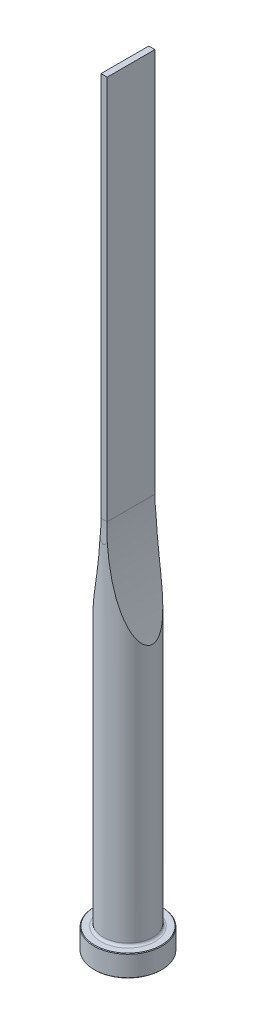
ISO-10303-21;
HEADER;
FILE_DESCRIPTION(('STEP AP214'),'2;1');
FILE_NAME('part.step','',(''),(''),'','','');
FILE_SCHEMA(('AUTOMOTIVE_DESIGN { 1 0 10303 214 1 1 1 1 }'));
ENDSEC;
DATA;
#1=APPLICATION_CONTEXT('core data for automotive mechanical design processes');
#2=APPLICATION_PROTOCOL_DEFINITION('international standard','automotive_design',2000,#1);
#3=PRODUCT_CONTEXT('',#1,'mechanical');
#4=PRODUCT('Part','Part','',(#3));
#5=PRODUCT_RELATED_PRODUCT_CATEGORY('part','',(#4));
#6=PRODUCT_DEFINITION_FORMATION('','',#4);
#7=PRODUCT_DEFINITION_CONTEXT('part definition',#1,'design');
#8=PRODUCT_DEFINITION('design','',#6,#7);
#9=PRODUCT_DEFINITION_SHAPE('','',#8);
#10=(LENGTH_UNIT() NAMED_UNIT(*) SI_UNIT(.MILLI.,.METRE.));
#11=(NAMED_UNIT(*) PLANE_ANGLE_UNIT() SI_UNIT($,.RADIAN.));
#12=(NAMED_UNIT(*) SI_UNIT($,.STERADIAN.) SOLID_ANGLE_UNIT());
#13=UNCERTAINTY_MEASURE_WITH_UNIT(LENGTH_MEASURE(1.E-05),#10,'distance_accuracy_value','');
#14=(GEOMETRIC_REPRESENTATION_CONTEXT(3) GLOBAL_UNCERTAINTY_ASSIGNED_CONTEXT((#13)) GLOBAL_UNIT_ASSIGNED_CONTEXT((#10,
#11,#12)) REPRESENTATION_CONTEXT('',''));
#15=CARTESIAN_POINT('',(0.,0.,0.));
#16=DIRECTION('',(0.,0.,1.));
#17=DIRECTION('',(1.,0.,0.));
#18=AXIS2_PLACEMENT_3D('',#15,#16,#17);
#19=CARTESIAN_POINT('',(0.,0.,0.));
#20=DIRECTION('',(0.,1.,0.));
#21=DIRECTION('',(-1.,0.,0.));
#22=AXIS2_PLACEMENT_3D('',#19,#20,#21);
#23=PLANE('',#22);
#24=CARTESIAN_POINT('',(0.,0.,0.));
#25=DIRECTION('',(0.,1.,0.));
#26=DIRECTION('',(-1.,0.,0.));
#27=AXIS2_PLACEMENT_3D('',#24,#25,#26);
#28=CIRCLE('',#27,10.8);
#29=CARTESIAN_POINT('',(-10.8,0.,0.));
#30=VERTEX_POINT('',#29);
#31=EDGE_CURVE('E133',#30,#30,#28,.T.);
#32=ORIENTED_EDGE('',*,*,#31,.F.);
#33=EDGE_LOOP('',(#32));
#34=FACE_BOUND('',#33,.T.);
#35=ADVANCED_FACE('F32',(#34),#23,.F.);
#36=CARTESIAN_POINT('',(0.,0.,0.));
#37=DIRECTION('',(0.,1.,0.));
#38=DIRECTION('',(-1.,0.,0.));
#39=AXIS2_PLACEMENT_3D('',#36,#37,#38);
#40=CONICAL_SURFACE('',#39,10.8,0.785398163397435);
#41=CARTESIAN_POINT('',(0.,0.200000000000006,0.));
#42=DIRECTION('',(0.,1.,0.));
#43=DIRECTION('',(-1.,0.,0.));
#44=AXIS2_PLACEMENT_3D('',#41,#42,#43);
#45=CIRCLE('',#44,11.);
#46=CARTESIAN_POINT('',(-11.,0.200000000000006,0.));
#47=VERTEX_POINT('',#46);
#48=EDGE_CURVE('E130',#47,#47,#45,.T.);
#49=ORIENTED_EDGE('',*,*,#48,.F.);
#50=EDGE_LOOP('',(#49));
#51=FACE_BOUND('',#50,.T.);
#52=ORIENTED_EDGE('',*,*,#31,.T.);
#53=EDGE_LOOP('',(#52));
#54=FACE_BOUND('',#53,.T.);
#55=ADVANCED_FACE('F171',(#51,#54),#40,.T.);
#56=CARTESIAN_POINT('',(0.,250.,0.));
#57=DIRECTION('',(0.,1.,0.));
#58=DIRECTION('',(-1.,0.,0.));
#59=AXIS2_PLACEMENT_3D('',#56,#57,#58);
#60=CYLINDRICAL_SURFACE('',#59,11.);
#61=CARTESIAN_POINT('',(0.,6.8,0.));
#62=DIRECTION('',(0.,1.,0.));
#63=DIRECTION('',(-1.,0.,0.));
#64=AXIS2_PLACEMENT_3D('',#61,#62,#63);
#65=CIRCLE('',#64,11.);
#66=CARTESIAN_POINT('',(-11.,6.8,0.));
#67=VERTEX_POINT('',#66);
#68=EDGE_CURVE('E127',#67,#67,#65,.T.);
#69=ORIENTED_EDGE('',*,*,#68,.F.);
#70=EDGE_LOOP('',(#69));
#71=FACE_BOUND('',#70,.T.);
#72=ORIENTED_EDGE('',*,*,#48,.T.);
#73=EDGE_LOOP('',(#72));
#74=FACE_BOUND('',#73,.T.);
#75=ADVANCED_FACE('F176',(#71,#74),#60,.T.);
#76=CARTESIAN_POINT('',(0.,6.8,0.));
#77=DIRECTION('',(0.,-1.,0.));
#78=DIRECTION('',(1.,0.,0.));
#79=AXIS2_PLACEMENT_3D('',#76,#77,#78);
#80=CONICAL_SURFACE('',#79,11.,0.78539816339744);
#81=CARTESIAN_POINT('',(0.,7.00000000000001,0.));
#82=DIRECTION('',(0.,1.,0.));
#83=DIRECTION('',(-1.,0.,0.));
#84=AXIS2_PLACEMENT_3D('',#81,#82,#83);
#85=CIRCLE('',#84,10.8);
#86=CARTESIAN_POINT('',(-10.8,7.00000000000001,0.));
#87=VERTEX_POINT('',#86);
#88=EDGE_CURVE('E124',#87,#87,#85,.T.);
#89=ORIENTED_EDGE('',*,*,#88,.F.);
#90=EDGE_LOOP('',(#89));
#91=FACE_BOUND('',#90,.T.);
#92=ORIENTED_EDGE('',*,*,#68,.T.);
#93=EDGE_LOOP('',(#92));
#94=FACE_BOUND('',#93,.T.);
#95=ADVANCED_FACE('F183',(#91,#94),#80,.T.);
#96=CARTESIAN_POINT('',(10.8,7.,0.));
#97=DIRECTION('',(0.,-1.,0.));
#98=DIRECTION('',(1.,0.,0.));
#99=AXIS2_PLACEMENT_3D('',#96,#97,#98);
#100=PLANE('',#99);
#101=CARTESIAN_POINT('',(0.,7.00000000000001,0.));
#102=DIRECTION('',(0.,1.,0.));
#103=DIRECTION('',(-1.,0.,0.));
#104=AXIS2_PLACEMENT_3D('',#101,#102,#103);
#105=CIRCLE('',#104,8.80000000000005);
#106=CARTESIAN_POINT('',(-8.80000000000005,7.00000000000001,0.));
#107=VERTEX_POINT('',#106);
#108=EDGE_CURVE('E121',#107,#107,#105,.T.);
#109=ORIENTED_EDGE('',*,*,#108,.F.);
#110=EDGE_LOOP('',(#109));
#111=FACE_BOUND('',#110,.T.);
#112=ORIENTED_EDGE('',*,*,#88,.T.);
#113=EDGE_LOOP('',(#112));
#114=FACE_BOUND('',#113,.T.);
#115=ADVANCED_FACE('F190',(#111,#114),#100,.F.);
#116=CARTESIAN_POINT('',(0.,7.8,0.));
#117=DIRECTION('',(0.,1.,0.));
#118=DIRECTION('',(-1.,0.,0.));
#119=AXIS2_PLACEMENT_3D('',#116,#117,#118);
#120=TOROIDAL_SURFACE('',#119,8.80000000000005,0.8);
#121=CARTESIAN_POINT('',(0.,7.8,0.));
#122=DIRECTION('',(0.,1.,0.));
#123=DIRECTION('',(-1.,0.,0.));
#124=AXIS2_PLACEMENT_3D('',#121,#122,#123);
#125=CIRCLE('',#124,8.00000000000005);
#126=CARTESIAN_POINT('',(-8.00000000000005,7.8,0.));
#127=VERTEX_POINT('',#126);
#128=EDGE_CURVE('E112',#127,#127,#125,.T.);
#129=ORIENTED_EDGE('',*,*,#128,.F.);
#130=EDGE_LOOP('',(#129));
#131=FACE_BOUND('',#130,.T.);
#132=ORIENTED_EDGE('',*,*,#108,.T.);
#133=EDGE_LOOP('',(#132));
#134=FACE_BOUND('',#133,.T.);
#135=ADVANCED_FACE('F168',(#131,#134),#120,.F.);
#136=CARTESIAN_POINT('',(0.,250.,0.));
#137=DIRECTION('',(0.,1.,0.));
#138=DIRECTION('',(-1.,0.,0.));
#139=AXIS2_PLACEMENT_3D('',#136,#137,#138);
#140=CYLINDRICAL_SURFACE('',#139,8.00000000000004);
#141=CARTESIAN_POINT('',(8.00000000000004,90.2005747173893,0.));
#142=CARTESIAN_POINT('',(7.99999968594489,90.2005754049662,0.0951898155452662));
#143=CARTESIAN_POINT('',(7.99829512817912,90.2046400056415,0.190388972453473));
#144=CARTESIAN_POINT('',(7.99153454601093,90.2207716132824,0.380003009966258));
#145=CARTESIAN_POINT('',(7.98647695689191,90.2328423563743,0.474417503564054));
#146=CARTESIAN_POINT('',(7.96644485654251,90.2806970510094,0.75562565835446));
#147=CARTESIAN_POINT('',(7.9466114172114,90.3281225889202,0.940195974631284));
#148=CARTESIAN_POINT('',(7.89043863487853,90.4629601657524,1.33784788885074));
#149=CARTESIAN_POINT('',(7.85143072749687,90.5568669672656,1.54828766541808));
#150=CARTESIAN_POINT('',(7.76144530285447,90.7749091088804,1.95001230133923));
#151=CARTESIAN_POINT('',(7.71044783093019,90.8990948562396,2.1412644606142));
#152=CARTESIAN_POINT('',(7.61166213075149,91.1414918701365,2.46682573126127));
#153=CARTESIAN_POINT('',(7.56539596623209,91.2556156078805,2.60472561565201));
#154=CARTESIAN_POINT('',(7.46905337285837,91.4948127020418,2.86933440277));
#155=CARTESIAN_POINT('',(7.41897455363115,91.6198929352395,2.99603617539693));
#156=CARTESIAN_POINT('',(7.31603232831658,91.8788132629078,3.23931243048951));
#157=CARTESIAN_POINT('',(7.2631644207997,92.0126676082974,3.35586968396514));
#158=CARTESIAN_POINT('',(7.1555104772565,92.2872602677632,3.57967746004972));
#159=CARTESIAN_POINT('',(7.1007236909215,92.4280012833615,3.68692428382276));
#160=CARTESIAN_POINT('',(6.99000672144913,92.7146384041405,3.8927403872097));
#161=CARTESIAN_POINT('',(6.93407976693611,92.8605206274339,3.99133084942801));
#162=CARTESIAN_POINT('',(6.82140223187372,93.1568085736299,4.18098308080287));
#163=CARTESIAN_POINT('',(6.76465148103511,93.3072152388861,4.27204326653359));
#164=CARTESIAN_POINT('',(6.59364355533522,93.764240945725,4.53517276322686));
#165=CARTESIAN_POINT('',(6.47870157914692,94.0764826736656,4.69706305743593));
#166=CARTESIAN_POINT('',(6.24883926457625,94.7121248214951,4.99879708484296));
#167=CARTESIAN_POINT('',(6.13391945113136,95.035546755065,5.13859505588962));
#168=CARTESIAN_POINT('',(5.9626899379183,95.5265207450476,5.33420973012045));
#169=CARTESIAN_POINT('',(5.90581545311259,95.6911215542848,5.39705734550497));
#170=CARTESIAN_POINT('',(5.79254575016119,96.0220718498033,5.51845204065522));
#171=CARTESIAN_POINT('',(5.73615054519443,96.1884213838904,5.57699900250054));
#172=CARTESIAN_POINT('',(5.59290285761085,96.615097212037,5.72143005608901));
#173=CARTESIAN_POINT('',(5.50645869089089,96.8765072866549,5.80452149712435));
#174=CARTESIAN_POINT('',(5.33524655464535,97.4024182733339,5.96227192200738));
#175=CARTESIAN_POINT('',(5.2504787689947,97.6669195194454,6.0369299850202));
#176=CARTESIAN_POINT('',(5.08280932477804,98.1986180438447,6.17876308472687));
#177=CARTESIAN_POINT('',(4.99990838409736,98.4658163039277,6.2459352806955));
#178=CARTESIAN_POINT('',(4.83616806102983,99.0024463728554,6.37355758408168));
#179=CARTESIAN_POINT('',(4.75532879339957,99.2718783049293,6.43400731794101));
#180=CARTESIAN_POINT('',(4.51582379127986,100.084019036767,6.60652825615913));
#181=CARTESIAN_POINT('',(4.36046377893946,100.629644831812,6.70952926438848));
#182=CARTESIAN_POINT('',(4.05935063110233,101.726686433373,6.89586397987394));
#183=CARTESIAN_POINT('',(3.91359581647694,102.278101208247,6.97920113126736));
#184=CARTESIAN_POINT('',(3.63139933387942,103.388488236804,7.1301237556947));
#185=CARTESIAN_POINT('',(3.49500918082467,103.947484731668,7.19762637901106));
#186=CARTESIAN_POINT('',(3.23268287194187,105.069371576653,7.3191969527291));
#187=CARTESIAN_POINT('',(3.10674701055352,105.632262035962,7.37326452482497));
#188=CARTESIAN_POINT('',(2.86565816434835,106.760745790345,7.47026525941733));
#189=CARTESIAN_POINT('',(2.75049540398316,107.326336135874,7.51320857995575));
#190=CARTESIAN_POINT('',(2.53096880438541,108.460229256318,7.58997438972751));
#191=CARTESIAN_POINT('',(2.42660522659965,109.028532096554,7.6237966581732));
#192=CARTESIAN_POINT('',(2.22464626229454,110.191247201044,7.68521631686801));
#193=CARTESIAN_POINT('',(2.12751672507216,110.78575706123,7.71249406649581));
#194=CARTESIAN_POINT('',(1.94517731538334,111.976882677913,7.76048765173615));
#195=CARTESIAN_POINT('',(1.85996788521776,112.57349851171,7.78120324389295));
#196=CARTESIAN_POINT('',(1.70152266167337,113.768556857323,7.81737954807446));
#197=CARTESIAN_POINT('',(1.62828851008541,114.36699960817,7.83283953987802));
#198=CARTESIAN_POINT('',(1.49385218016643,115.565328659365,7.85958657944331));
#199=CARTESIAN_POINT('',(1.43265005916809,116.165214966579,7.87087360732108));
#200=CARTESIAN_POINT('',(1.32225717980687,117.366733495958,7.89016969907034));
#201=CARTESIAN_POINT('',(1.27307820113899,117.968366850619,7.89817555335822));
#202=CARTESIAN_POINT('',(1.18683300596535,119.172530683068,7.91159474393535));
#203=CARTESIAN_POINT('',(1.14976682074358,119.775061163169,7.91700807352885));
#204=CARTESIAN_POINT('',(1.08776652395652,120.980719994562,7.92576455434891));
#205=CARTESIAN_POINT('',(1.06283159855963,121.583848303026,7.9291078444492));
#206=CARTESIAN_POINT('',(1.02510116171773,122.790490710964,7.93407395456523));
#207=CARTESIAN_POINT('',(1.01230563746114,123.394004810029,7.9356967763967));
#208=CARTESIAN_POINT('',(0.998864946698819,124.600680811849,7.9373997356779));
#209=CARTESIAN_POINT('',(0.998209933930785,125.203842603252,7.937481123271));
#210=CARTESIAN_POINT('',(1.00902540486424,126.410056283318,7.93611350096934));
#211=CARTESIAN_POINT('',(1.02049589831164,127.013108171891,7.9346644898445));
#212=CARTESIAN_POINT('',(1.05555842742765,128.218886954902,7.93007624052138));
#213=CARTESIAN_POINT('',(1.07915113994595,128.821613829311,7.92693690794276));
#214=CARTESIAN_POINT('',(1.13844803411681,130.026456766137,7.91863830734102));
#215=CARTESIAN_POINT('',(1.17415218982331,130.628572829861,7.91347904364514));
#216=CARTESIAN_POINT('',(1.25761963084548,131.831420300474,7.90064394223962));
#217=CARTESIAN_POINT('',(1.30537248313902,132.432152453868,7.89297028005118));
#218=CARTESIAN_POINT('',(1.41292919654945,133.632487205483,7.87442760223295));
#219=CARTESIAN_POINT('',(1.47273302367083,134.232089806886,7.86355859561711));
#220=CARTESIAN_POINT('',(1.60435274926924,135.429821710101,7.83776437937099));
#221=CARTESIAN_POINT('',(1.67616729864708,136.027951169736,7.82283962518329));
#222=CARTESIAN_POINT('',(1.83176793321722,137.222485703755,7.7878743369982));
#223=CARTESIAN_POINT('',(1.91555365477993,137.818890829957,7.7678339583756));
#224=CARTESIAN_POINT('',(2.09527994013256,139.011253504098,7.72129816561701));
#225=CARTESIAN_POINT('',(2.19125242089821,139.607205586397,7.6947856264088));
#226=CARTESIAN_POINT('',(2.39509132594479,140.796652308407,7.63379718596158));
#227=CARTESIAN_POINT('',(2.50295739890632,141.390147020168,7.59932151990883));
#228=CARTESIAN_POINT('',(2.73054263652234,142.574606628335,7.5205487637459));
#229=CARTESIAN_POINT('',(2.85026925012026,143.165569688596,7.47624547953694));
#230=CARTESIAN_POINT('',(3.10135018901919,144.343998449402,7.3756307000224));
#231=CARTESIAN_POINT('',(3.23270432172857,144.931464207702,7.31931940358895));
#232=CARTESIAN_POINT('',(3.50633260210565,146.100167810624,7.19224086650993));
#233=CARTESIAN_POINT('',(3.64856803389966,146.681420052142,7.12152351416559));
#234=CARTESIAN_POINT('',(3.94400085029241,147.838777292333,6.96225785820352));
#235=CARTESIAN_POINT('',(4.09719959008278,148.414881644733,6.87370734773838));
#236=CARTESIAN_POINT('',(4.41379154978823,149.559734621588,6.67483610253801));
#237=CARTESIAN_POINT('',(4.57717072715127,150.128492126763,6.56454492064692));
#238=CARTESIAN_POINT('',(4.82930445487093,150.974949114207,6.3787649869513));
#239=CARTESIAN_POINT('',(4.91451623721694,151.255956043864,6.31345656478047));
#240=CARTESIAN_POINT('',(5.08713730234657,151.815399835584,6.175215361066));
#241=CARTESIAN_POINT('',(5.17454640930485,152.093836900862,6.10228318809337));
#242=CARTESIAN_POINT('',(5.32140384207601,152.55385844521,5.97400009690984));
#243=CARTESIAN_POINT('',(5.38029215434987,152.736296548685,5.92106403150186));
#244=CARTESIAN_POINT('',(5.49886094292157,153.099675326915,5.81111513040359));
#245=CARTESIAN_POINT('',(5.55854140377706,153.28061603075,5.75410237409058));
#246=CARTESIAN_POINT('',(5.7386773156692,153.821016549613,5.57638921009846));
#247=CARTESIAN_POINT('',(5.86020024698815,154.177970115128,5.44903714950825));
#248=CARTESIAN_POINT('',(6.10470062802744,154.881872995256,5.1736342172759));
#249=CARTESIAN_POINT('',(6.22767165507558,155.228852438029,5.02565587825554));
#250=CARTESIAN_POINT('',(6.41230815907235,155.740125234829,4.78460865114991));
#251=CARTESIAN_POINT('',(6.47387012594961,155.908980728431,4.70110003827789));
#252=CARTESIAN_POINT('',(6.59678680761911,156.243067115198,4.52700525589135));
#253=CARTESIAN_POINT('',(6.65814155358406,156.408298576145,4.4364202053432));
#254=CARTESIAN_POINT('',(6.77281683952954,156.714428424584,4.25895492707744));
#255=CARTESIAN_POINT('',(6.8262005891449,156.855827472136,4.17298092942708));
#256=CARTESIAN_POINT('',(6.93224266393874,157.134629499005,3.99434661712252));
#257=CARTESIAN_POINT('',(6.98490101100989,157.272032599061,3.90168650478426));
#258=CARTESIAN_POINT('',(7.08925706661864,157.542407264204,3.70870602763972));
#259=CARTESIAN_POINT('',(7.14095162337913,157.675365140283,3.6083646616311));
#260=CARTESIAN_POINT('',(7.24271906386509,157.935351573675,3.39948932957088));
#261=CARTESIAN_POINT('',(7.2927919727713,158.062380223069,3.29095549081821));
#262=CARTESIAN_POINT('',(7.3914463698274,158.311077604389,3.06303123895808));
#263=CARTESIAN_POINT('',(7.43999201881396,158.432630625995,2.9434969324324));
#264=CARTESIAN_POINT('',(7.53381793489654,158.666190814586,2.69432317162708));
#265=CARTESIAN_POINT('',(7.57909710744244,158.778194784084,2.56468036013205));
#266=CARTESIAN_POINT('',(7.70793180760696,159.095197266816,2.16037788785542));
#267=CARTESIAN_POINT('',(7.78519729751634,159.282972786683,1.86879216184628));
#268=CARTESIAN_POINT('',(7.88033493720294,159.512738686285,1.38899625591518));
#269=CARTESIAN_POINT('',(7.90910974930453,159.58189769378,1.21587879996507));
#270=CARTESIAN_POINT('',(7.95568575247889,159.693594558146,0.859756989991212));
#271=CARTESIAN_POINT('',(7.97349730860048,159.736157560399,0.676762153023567));
#272=CARTESIAN_POINT('',(7.99640047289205,159.790852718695,0.304240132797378));
#273=CARTESIAN_POINT('',(8.00141393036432,159.802797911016,0.114679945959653));
#274=CARTESIAN_POINT('',(7.99789292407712,159.794399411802,-0.26361005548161));
#275=CARTESIAN_POINT('',(7.98935682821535,159.774051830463,-0.452339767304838));
#276=CARTESIAN_POINT('',(7.96081303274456,159.705829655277,-0.809502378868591));
#277=CARTESIAN_POINT('',(7.94167563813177,159.660042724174,-0.978418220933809));
#278=CARTESIAN_POINT('',(7.89424584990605,159.546163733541,-1.30709937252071));
#279=CARTESIAN_POINT('',(7.86594930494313,159.47806155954,-1.46686049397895));
#280=CARTESIAN_POINT('',(7.78372128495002,159.27926575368,-1.86420721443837));
#281=CARTESIAN_POINT('',(7.72439416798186,159.135073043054,-2.0938918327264));
#282=CARTESIAN_POINT('',(7.59397693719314,158.815163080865,-2.52644457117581));
#283=CARTESIAN_POINT('',(7.52285251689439,158.639353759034,-2.72923128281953));
#284=CARTESIAN_POINT('',(7.38255555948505,158.28895057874,-3.08707888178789));
#285=CARTESIAN_POINT('',(7.31420744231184,158.116835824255,-3.24494358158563));
#286=CARTESIAN_POINT('',(7.17393251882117,157.760146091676,-3.54429794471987));
#287=CARTESIAN_POINT('',(7.10200284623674,157.575561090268,-3.68577418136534));
#288=CARTESIAN_POINT('',(6.95590090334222,157.196750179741,-3.95460160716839));
#289=CARTESIAN_POINT('',(6.88172471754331,157.002507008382,-4.08192608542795));
#290=CARTESIAN_POINT('',(6.7322714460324,156.606876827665,-4.32397115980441));
#291=CARTESIAN_POINT('',(6.65699468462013,156.405491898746,-4.43869538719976));
#292=CARTESIAN_POINT('',(6.47952844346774,155.925334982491,-4.69552369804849));
#293=CARTESIAN_POINT('',(6.3771673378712,155.644212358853,-4.8331028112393));
#294=CARTESIAN_POINT('',(6.17288514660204,155.074115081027,-5.09142149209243));
#295=CARTESIAN_POINT('',(6.07096426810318,154.785137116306,-5.21215382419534));
#296=CARTESIAN_POINT('',(5.86824674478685,154.200692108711,-5.43938317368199));
#297=CARTESIAN_POINT('',(5.76745219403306,153.905215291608,-5.54585675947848));
#298=CARTESIAN_POINT('',(5.56774519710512,153.309513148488,-5.74632195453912));
#299=CARTESIAN_POINT('',(5.46883248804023,153.009288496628,-5.84031531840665));
#300=CARTESIAN_POINT('',(5.27282470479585,152.403526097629,-6.01788020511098));
#301=CARTESIAN_POINT('',(5.17574034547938,152.097970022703,-6.10140072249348));
#302=CARTESIAN_POINT('',(4.98417270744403,151.483598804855,-6.25886492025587));
#303=CARTESIAN_POINT('',(4.8896894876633,151.174783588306,-6.33280838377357));
#304=CARTESIAN_POINT('',(4.70363882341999,150.554700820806,-6.4721926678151));
#305=CARTESIAN_POINT('',(4.61206878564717,150.243435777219,-6.53764122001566));
#306=CARTESIAN_POINT('',(4.43192525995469,149.618573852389,-6.66107734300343));
#307=CARTESIAN_POINT('',(4.34335180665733,149.304976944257,-6.71906482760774));
#308=CARTESIAN_POINT('',(4.12841382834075,148.527809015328,-6.85412728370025));
#309=CARTESIAN_POINT('',(4.00386624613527,148.063064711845,-6.92735391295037));
#310=CARTESIAN_POINT('',(3.76184032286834,147.129976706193,-7.06170615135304));
#311=CARTESIAN_POINT('',(3.64436267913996,146.661632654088,-7.12283056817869));
#312=CARTESIAN_POINT('',(3.41666459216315,145.721805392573,-7.23481178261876));
#313=CARTESIAN_POINT('',(3.30644657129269,145.25032119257,-7.28566516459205));
#314=CARTESIAN_POINT('',(3.09346099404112,144.304799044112,-7.3786174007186));
#315=CARTESIAN_POINT('',(2.99069379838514,143.830760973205,-7.42071583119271));
#316=CARTESIAN_POINT('',(2.79255626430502,142.879687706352,-7.49752866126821));
#317=CARTESIAN_POINT('',(2.69719907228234,142.402648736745,-7.53223011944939));
#318=CARTESIAN_POINT('',(2.51416019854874,141.446671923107,-7.59528568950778));
#319=CARTESIAN_POINT('',(2.42647875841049,140.96773401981,-7.62363960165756));
#320=CARTESIAN_POINT('',(2.25887310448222,140.008314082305,-7.6749707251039));
#321=CARTESIAN_POINT('',(2.17894737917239,139.527832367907,-7.69794898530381));
#322=CARTESIAN_POINT('',(2.02687944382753,138.565440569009,-7.73937658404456));
#323=CARTESIAN_POINT('',(1.95473741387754,138.083530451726,-7.75782581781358));
#324=CARTESIAN_POINT('',(1.74970689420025,136.633559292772,-7.80759135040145));
#325=CARTESIAN_POINT('',(1.62862431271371,135.663605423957,-7.83320749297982));
#326=CARTESIAN_POINT('',(1.41810393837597,133.720061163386,-7.87403437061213));
#327=CARTESIAN_POINT('',(1.3286671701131,132.746470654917,-7.88924476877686));
#328=CARTESIAN_POINT('',(1.18163064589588,130.797783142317,-7.91260337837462));
#329=CARTESIAN_POINT('',(1.12399909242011,129.822688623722,-7.92075864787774));
#330=CARTESIAN_POINT('',(1.04050604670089,127.87112630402,-7.93215646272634));
#331=CARTESIAN_POINT('',(1.01464433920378,126.894658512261,-7.93539904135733));
#332=CARTESIAN_POINT('',(0.993960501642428,124.866933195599,-7.93802255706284));
#333=CARTESIAN_POINT('',(1.00165471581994,123.815648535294,-7.93709028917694));
#334=CARTESIAN_POINT('',(1.05386528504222,121.713991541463,-7.93032404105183));
#335=CARTESIAN_POINT('',(1.09838262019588,120.663619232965,-7.92448993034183));
#336=CARTESIAN_POINT('',(1.22425539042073,118.563934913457,-7.90602973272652));
#337=CARTESIAN_POINT('',(1.30565178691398,117.514625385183,-7.89339609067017));
#338=CARTESIAN_POINT('',(1.4552832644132,115.943481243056,-7.8666789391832));
#339=CARTESIAN_POINT('',(1.50975015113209,115.420234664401,-7.8564787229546));
#340=CARTESIAN_POINT('',(1.62784054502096,114.374851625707,-7.83286557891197));
#341=CARTESIAN_POINT('',(1.69146386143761,113.852715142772,-7.8194527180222));
#342=CARTESIAN_POINT('',(1.82736746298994,112.813351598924,-7.78880876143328));
#343=CARTESIAN_POINT('',(1.89958495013,112.296115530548,-7.7716046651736));
#344=CARTESIAN_POINT('',(2.05298255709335,111.263162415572,-7.73249834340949));
#345=CARTESIAN_POINT('',(2.13416245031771,110.747445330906,-7.71059623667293));
#346=CARTESIAN_POINT('',(2.30545556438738,109.717647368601,-7.66112428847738));
#347=CARTESIAN_POINT('',(2.39557077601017,109.203566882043,-7.63355318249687));
#348=CARTESIAN_POINT('',(2.58465162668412,108.177445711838,-7.57162306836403));
#349=CARTESIAN_POINT('',(2.68361718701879,107.665405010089,-7.53726412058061));
#350=CARTESIAN_POINT('',(2.89011341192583,106.644659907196,-7.46051995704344));
#351=CARTESIAN_POINT('',(2.99762759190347,106.135951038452,-7.41814998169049));
#352=CARTESIAN_POINT('',(3.22126242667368,105.121289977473,-7.32381077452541));
#353=CARTESIAN_POINT('',(3.33738341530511,104.615337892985,-7.27184117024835));
#354=CARTESIAN_POINT('',(3.57799451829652,103.606975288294,-7.15651798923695));
#355=CARTESIAN_POINT('',(3.70248069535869,103.104563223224,-7.09316974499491));
#356=CARTESIAN_POINT('',(3.95961162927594,102.103764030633,-6.95290946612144));
#357=CARTESIAN_POINT('',(4.09225533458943,101.605376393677,-6.87599917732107));
#358=CARTESIAN_POINT('',(4.27445498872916,100.943619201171,-6.76253743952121));
#359=CARTESIAN_POINT('',(4.32055424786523,100.778043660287,-6.73319330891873));
#360=CARTESIAN_POINT('',(4.41360552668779,100.44748954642,-6.67256862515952));
#361=CARTESIAN_POINT('',(4.46055753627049,100.282510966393,-6.64128809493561));
#362=CARTESIAN_POINT('',(4.60266899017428,99.7885222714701,-6.54435661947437));
#363=CARTESIAN_POINT('',(4.69908104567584,99.4604694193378,-6.47561752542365));
#364=CARTESIAN_POINT('',(4.89528849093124,98.8065760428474,-6.32860339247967));
#365=CARTESIAN_POINT('',(4.99509178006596,98.4807431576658,-6.25030480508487));
#366=CARTESIAN_POINT('',(5.19757687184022,97.8327511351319,-6.08296344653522));
#367=CARTESIAN_POINT('',(5.30025857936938,97.5105918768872,-5.9939210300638));
#368=CARTESIAN_POINT('',(5.52510687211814,96.8185227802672,-5.78792965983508));
#369=CARTESIAN_POINT('',(5.64771898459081,96.4493986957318,-5.66879789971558));
#370=CARTESIAN_POINT('',(5.89557187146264,95.7188599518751,-5.41057194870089));
#371=CARTESIAN_POINT('',(6.02081370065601,95.3574485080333,-5.27146961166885));
#372=CARTESIAN_POINT('',(6.27217794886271,94.6464572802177,-4.96973910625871));
#373=CARTESIAN_POINT('',(6.39829525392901,94.296837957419,-4.80720179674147));
#374=CARTESIAN_POINT('',(6.58685583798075,93.7837478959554,-4.54147910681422));
#375=CARTESIAN_POINT('',(6.64958449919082,93.6146660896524,-4.44928894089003));
#376=CARTESIAN_POINT('',(6.7744756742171,93.2810352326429,-4.25672096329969));
#377=CARTESIAN_POINT('',(6.83663831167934,93.1164851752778,-4.15634498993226));
#378=CARTESIAN_POINT('',(6.94405120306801,92.8345838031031,-3.97345109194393));
#379=CARTESIAN_POINT('',(6.98953447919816,92.7159898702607,-3.89299059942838));
#380=CARTESIAN_POINT('',(7.07966167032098,92.4824274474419,-3.72657104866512));
#381=CARTESIAN_POINT('',(7.12430560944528,92.3674588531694,-3.64061214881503));
#382=CARTESIAN_POINT('',(7.2567030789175,92.0285154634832,-3.37342059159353));
#383=CARTESIAN_POINT('',(7.34280651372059,91.8108061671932,-3.18306526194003));
#384=CARTESIAN_POINT('',(7.4663241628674,91.5016770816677,-2.87512473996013));
#385=CARTESIAN_POINT('',(7.50678239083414,91.4009897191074,-2.76803236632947));
#386=CARTESIAN_POINT('',(7.58493975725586,91.2074174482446,-2.54609245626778));
#387=CARTESIAN_POINT('',(7.62263834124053,91.1145341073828,-2.4312433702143));
#388=CARTESIAN_POINT('',(7.73022265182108,90.8506243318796,-2.07483501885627));
#389=CARTESIAN_POINT('',(7.79494270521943,90.6934768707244,-1.82059217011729));
#390=CARTESIAN_POINT('',(7.8817867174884,90.4837645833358,-1.38106361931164));
#391=CARTESIAN_POINT('',(7.91080089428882,90.4140401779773,-1.20529404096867));
#392=CARTESIAN_POINT('',(7.95743556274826,90.3022161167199,-0.843869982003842));
#393=CARTESIAN_POINT('',(7.97508793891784,90.2600391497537,-0.658244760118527));
#394=CARTESIAN_POINT('',(7.99075240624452,90.2226377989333,-0.392445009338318));
#395=CARTESIAN_POINT('',(7.99421164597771,90.2143833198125,-0.314251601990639));
#396=CARTESIAN_POINT('',(7.99883587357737,90.2033507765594,-0.157374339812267));
#397=CARTESIAN_POINT('',(8.00000025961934,90.2005741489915,-0.0786903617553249));
#398=CARTESIAN_POINT('',(8.00000000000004,90.2005747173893,0.));
#399=B_SPLINE_CURVE_WITH_KNOTS('',3,(#141,#142,#143,#144,#145,#146,#147,#148,#149,#150,#151,
#152,#153,#154,#155,#156,#157,#158,#159,#160,#161,#162,#163,#164,#165,#166,#167,#168,#169,#170,
#171,#172,#173,#174,#175,#176,#177,#178,#179,#180,#181,#182,#183,#184,#185,#186,#187,#188,#189,
#190,#191,#192,#193,#194,#195,#196,#197,#198,#199,#200,#201,#202,#203,#204,#205,#206,#207,#208,
#209,#210,#211,#212,#213,#214,#215,#216,#217,#218,#219,#220,#221,#222,#223,#224,#225,#226,#227,
#228,#229,#230,#231,#232,#233,#234,#235,#236,#237,#238,#239,#240,#241,#242,#243,#244,#245,#246,
#247,#248,#249,#250,#251,#252,#253,#254,#255,#256,#257,#258,#259,#260,#261,#262,#263,#264,#265,
#266,#267,#268,#269,#270,#271,#272,#273,#274,#275,#276,#277,#278,#279,#280,#281,#282,#283,#284,
#285,#286,#287,#288,#289,#290,#291,#292,#293,#294,#295,#296,#297,#298,#299,#300,#301,#302,#303,
#304,#305,#306,#307,#308,#309,#310,#311,#312,#313,#314,#315,#316,#317,#318,#319,#320,#321,#322,
#323,#324,#325,#326,#327,#328,#329,#330,#331,#332,#333,#334,#335,#336,#337,#338,#339,#340,#341,
#342,#343,#344,#345,#346,#347,#348,#349,#350,#351,#352,#353,#354,#355,#356,#357,#358,#359,#360,
#361,#362,#363,#364,#365,#366,#367,#368,#369,#370,#371,#372,#373,#374,#375,#376,#377,#378,#379,
#380,#381,#382,#383,#384,#385,#386,#387,#388,#389,#390,#391,#392,#393,#394,#395,#396,#397,#398),
.UNSPECIFIED.,.T.,.F.,(4,2,2,2,2,2,2,2,2,2,2,2,2,2,2,2,2,2,2,2,2,2,2,2,2,2,2,2,2,2,2,2,2,2,2,2,
2,2,2,2,2,2,2,2,2,2,2,2,2,2,2,2,2,2,2,2,2,2,2,2,2,2,2,2,2,2,2,2,2,2,2,2,2,2,2,2,2,2,2,2,2,2,2,2,
2,2,2,2,2,2,2,2,2,2,2,2,2,2,2,2,2,2,2,2,2,2,2,2,2,2,2,2,2,2,2,2,2,2,2,2,2,2,2,2,2,2,2,2,4),(0.,
0.285476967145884,0.571087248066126,1.14286351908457,1.84022525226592,2.53875595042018,
3.09264451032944,3.64688324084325,4.2020456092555,4.75742753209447,5.31141014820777,
5.86550895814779,6.97440699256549,8.08557271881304,8.64095204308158,9.19634658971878,
10.0589618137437,10.921671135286,11.7847067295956,12.6477902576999,14.3769622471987,
16.1058311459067,17.8435535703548,19.5813249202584,21.3175037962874,23.0537246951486,
24.8625858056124,26.6715140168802,28.4806900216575,30.2898746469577,32.1008247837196,
33.911779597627,35.7226129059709,37.5334443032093,39.3428070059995,41.1521711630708,
42.9616363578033,44.7710976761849,46.5789975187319,48.3868922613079,50.1945840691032,
52.0022209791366,53.8146936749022,55.6271128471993,57.4406776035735,59.2542123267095,
61.061570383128,62.8691522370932,64.6742937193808,65.5766552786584,66.4789448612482,
67.0755435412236,67.6721306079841,68.8655800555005,70.0549339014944,70.6493500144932,
71.2436723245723,71.765166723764,72.2866453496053,72.8096044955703,73.3325555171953,
73.8637307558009,74.3950831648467,75.4504562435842,76.0143632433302,76.577736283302,
77.1445413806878,77.7114147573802,78.2374688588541,78.7637617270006,79.5918212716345,
80.422332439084,81.1513093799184,81.8808793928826,82.6118038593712,83.3425171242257,
84.3297266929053,85.3173589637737,86.3065948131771,87.2956914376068,88.2894321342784,
89.2831953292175,90.2760476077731,91.2689113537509,92.7287019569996,94.1886363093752,
95.6490553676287,97.109545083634,98.5725694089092,100.035639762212,101.498424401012,
102.96124287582,105.894034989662,108.826922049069,111.756871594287,114.686801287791,
117.840072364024,120.993427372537,124.15029341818,125.728737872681,127.307149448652,
128.874664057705,130.442139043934,132.009964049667,133.577775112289,135.142633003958,
136.707551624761,138.27173876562,139.83572469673,140.358794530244,140.881858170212,
141.928017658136,142.976808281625,144.02556429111,145.24544405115,146.465822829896,
147.681591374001,148.289041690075,148.896355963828,149.347280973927,149.798192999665,
150.701144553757,151.158134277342,151.615215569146,152.525694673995,153.097588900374,
153.667871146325,153.903803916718,154.139798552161),.UNSPECIFIED.);
#400=CARTESIAN_POINT('',(1.16475494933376,119.556770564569,-7.91475494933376));
#401=VERTEX_POINT('',#400);
#402=CARTESIAN_POINT('',(1.16475494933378,119.556770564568,7.91475494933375));
#403=VERTEX_POINT('',#402);
#404=EDGE_CURVE('E138',#401,#403,#399,.T.);
#405=ORIENTED_EDGE('',*,*,#404,.T.);
#406=CARTESIAN_POINT('',(-1.98431348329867,125.,7.74999999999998));
#407=CARTESIAN_POINT('',(-1.98431671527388,125.310227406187,7.75000012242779));
#408=CARTESIAN_POINT('',(-1.97807758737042,125.620470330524,7.75160504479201));
#409=CARTESIAN_POINT('',(-1.95278869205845,126.240402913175,7.75801423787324));
#410=CARTESIAN_POINT('',(-1.93373880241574,126.550092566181,7.7628185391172));
#411=CARTESIAN_POINT('',(-1.88170740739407,127.168545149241,7.77559741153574));
#412=CARTESIAN_POINT('',(-1.84871351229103,127.477307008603,7.78357480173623));
#413=CARTESIAN_POINT('',(-1.76661059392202,128.092457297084,7.80261881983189));
#414=CARTESIAN_POINT('',(-1.71750945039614,128.398846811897,7.81368393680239));
#415=CARTESIAN_POINT('',(-1.59923669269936,129.00782620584,7.83876619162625));
#416=CARTESIAN_POINT('',(-1.53006503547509,129.310416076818,7.85278333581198));
#417=CARTESIAN_POINT('',(-1.40509547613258,129.758317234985,7.87574985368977));
#418=CARTESIAN_POINT('',(-1.35990520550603,129.906616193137,7.8837285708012));
#419=CARTESIAN_POINT('',(-1.26052233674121,130.200044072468,7.90023035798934));
#420=CARTESIAN_POINT('',(-1.20633656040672,130.345175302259,7.90875301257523));
#421=CARTESIAN_POINT('',(-1.08563979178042,130.631320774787,7.92623499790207));
#422=CARTESIAN_POINT('',(-1.01906689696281,130.77231003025,7.93519634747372));
#423=CARTESIAN_POINT('',(-0.905913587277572,130.976517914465,7.94863066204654));
#424=CARTESIAN_POINT('',(-0.865970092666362,131.043388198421,7.9531084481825));
#425=CARTESIAN_POINT('',(-0.78047725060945,131.173411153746,7.96195394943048));
#426=CARTESIAN_POINT('',(-0.734935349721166,131.236568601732,7.96632180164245));
#427=CARTESIAN_POINT('',(-0.636093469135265,131.357858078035,7.97482874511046));
#428=CARTESIAN_POINT('',(-0.582709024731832,131.415922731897,7.97896456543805));
#429=CARTESIAN_POINT('',(-0.46660600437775,131.521734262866,7.98659018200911));
#430=CARTESIAN_POINT('',(-0.403961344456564,131.569556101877,7.99008464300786));
#431=CARTESIAN_POINT('',(-0.303890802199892,131.626684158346,7.99429035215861));
#432=CARTESIAN_POINT('',(-0.27053575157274,131.643017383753,7.99549865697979));
#433=CARTESIAN_POINT('',(-0.201689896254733,131.670421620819,7.99753116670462));
#434=CARTESIAN_POINT('',(-0.166200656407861,131.681496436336,7.99835564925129));
#435=CARTESIAN_POINT('',(-0.0934740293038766,131.697347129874,7.99953699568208));
#436=CARTESIAN_POINT('',(-0.0562242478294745,131.702068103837,7.99988978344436));
#437=CARTESIAN_POINT('',(0.0184986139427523,131.704424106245,8.00006574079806));
#438=CARTESIAN_POINT('',(0.0559716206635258,131.70206135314,7.99988907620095));
#439=CARTESIAN_POINT('',(0.126456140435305,131.691099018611,7.99907121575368));
#440=CARTESIAN_POINT('',(0.159563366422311,131.683086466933,7.99847374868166));
#441=CARTESIAN_POINT('',(0.224196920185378,131.662232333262,7.9969233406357));
#442=CARTESIAN_POINT('',(0.255722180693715,131.649387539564,7.99597016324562));
#443=CARTESIAN_POINT('',(0.334694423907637,131.611135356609,7.99314270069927));
#444=CARTESIAN_POINT('',(0.380692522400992,131.582771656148,7.99105553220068));
#445=CARTESIAN_POINT('',(0.467817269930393,131.519390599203,7.98642960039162));
#446=CARTESIAN_POINT('',(0.508928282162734,131.484352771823,7.98388944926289));
#447=CARTESIAN_POINT('',(0.621519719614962,131.37679113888,7.97616511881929));
#448=CARTESIAN_POINT('',(0.687515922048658,131.298628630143,7.97063757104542));
#449=CARTESIAN_POINT('',(0.808549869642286,131.134392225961,7.95926471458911));
#450=CARTESIAN_POINT('',(0.863553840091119,131.048295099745,7.95341849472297));
#451=CARTESIAN_POINT('',(0.99512831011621,130.820249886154,7.93828495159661));
#452=CARTESIAN_POINT('',(1.06569888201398,130.674876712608,7.92896886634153));
#453=CARTESIAN_POINT('',(1.19356521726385,130.3782856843,7.91071942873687));
#454=CARTESIAN_POINT('',(1.25082971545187,130.227055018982,7.90178701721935));
#455=CARTESIAN_POINT('',(1.3557073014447,129.920417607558,7.88447171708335));
#456=CARTESIAN_POINT('',(1.40326961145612,129.764993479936,7.87609186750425));
#457=CARTESIAN_POINT('',(1.49048759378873,129.452132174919,7.86005026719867));
#458=CARTESIAN_POINT('',(1.53015172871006,129.294697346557,7.85238775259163));
#459=CARTESIAN_POINT('',(1.62389561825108,128.887904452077,7.83367180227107));
#460=CARTESIAN_POINT('',(1.67325812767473,128.637435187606,7.82318329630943));
#461=CARTESIAN_POINT('',(1.75948004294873,128.134239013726,7.80423839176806));
#462=CARTESIAN_POINT('',(1.79633420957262,127.881511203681,7.79578284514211));
#463=CARTESIAN_POINT('',(1.85947965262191,127.374226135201,7.78096344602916));
#464=CARTESIAN_POINT('',(1.88575180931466,127.119666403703,7.77460338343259));
#465=CARTESIAN_POINT('',(1.92879038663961,126.609697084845,7.76403451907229));
#466=CARTESIAN_POINT('',(1.94555558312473,126.354287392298,7.75982599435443));
#467=CARTESIAN_POINT('',(1.98269985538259,125.587295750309,7.75046498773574));
#468=CARTESIAN_POINT('',(1.98992728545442,125.074954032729,7.7485771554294));
#469=CARTESIAN_POINT('',(1.97529230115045,124.307450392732,7.75230076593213));
#470=CARTESIAN_POINT('',(1.96618074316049,124.051933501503,7.7546312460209));
#471=CARTESIAN_POINT('',(1.93906690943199,123.541399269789,7.76145849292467));
#472=CARTESIAN_POINT('',(1.92106540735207,123.286381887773,7.76595507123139));
#473=CARTESIAN_POINT('',(1.87471171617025,122.768760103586,7.7772774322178));
#474=CARTESIAN_POINT('',(1.84603457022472,122.506186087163,7.784175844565));
#475=CARTESIAN_POINT('',(1.77703413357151,121.982449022,7.80021933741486));
#476=CARTESIAN_POINT('',(1.73670382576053,121.721286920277,7.80936577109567));
#477=CARTESIAN_POINT('',(1.6422124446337,121.202440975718,7.82978141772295));
#478=CARTESIAN_POINT('',(1.58809931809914,120.944748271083,7.84104323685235));
#479=CARTESIAN_POINT('',(1.46204823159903,120.43402859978,7.86553499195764));
#480=CARTESIAN_POINT('',(1.39013277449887,120.180996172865,7.87876243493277));
#481=CARTESIAN_POINT('',(1.2459665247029,119.758208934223,7.90260735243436));
#482=CARTESIAN_POINT('',(1.18030295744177,119.586266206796,7.91281560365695));
#483=CARTESIAN_POINT('',(1.06809293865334,119.334388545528,7.92846600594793));
#484=CARTESIAN_POINT('',(1.02839107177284,119.251413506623,7.93374063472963));
#485=CARTESIAN_POINT('',(0.943234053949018,119.088500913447,7.94431637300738));
#486=CARTESIAN_POINT('',(0.897783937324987,119.008560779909,7.9496174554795));
#487=CARTESIAN_POINT('',(0.79911428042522,118.85280148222,7.96014485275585));
#488=CARTESIAN_POINT('',(0.745844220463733,118.777013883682,7.96537041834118));
#489=CARTESIAN_POINT('',(0.62929488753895,118.633608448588,7.9754260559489));
#490=CARTESIAN_POINT('',(0.566066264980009,118.565952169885,7.98025795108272));
#491=CARTESIAN_POINT('',(0.463628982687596,118.47801167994,7.98661948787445));
#492=CARTESIAN_POINT('',(0.429641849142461,118.451733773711,7.98853391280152));
#493=CARTESIAN_POINT('',(0.358459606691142,118.403785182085,7.99204480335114));
#494=CARTESIAN_POINT('',(0.321263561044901,118.382115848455,7.99364117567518));
#495=CARTESIAN_POINT('',(0.243194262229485,118.344815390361,7.99639908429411));
#496=CARTESIAN_POINT('',(0.202275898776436,118.329275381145,7.99755405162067));
#497=CARTESIAN_POINT('',(0.118169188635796,118.306672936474,7.99923672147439));
#498=CARTESIAN_POINT('',(0.0749872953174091,118.299587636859,7.99976611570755));
#499=CARTESIAN_POINT('',(-0.00588173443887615,118.295308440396,8.00008572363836));
#500=CARTESIAN_POINT('',(-0.043505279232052,118.296885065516,7.99996781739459));
#501=CARTESIAN_POINT('',(-0.11782777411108,118.306921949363,7.9992187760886));
#502=CARTESIAN_POINT('',(-0.15452571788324,118.315389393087,7.99858710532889));
#503=CARTESIAN_POINT('',(-0.23259589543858,118.340362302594,7.99673039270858));
#504=CARTESIAN_POINT('',(-0.273575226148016,118.358065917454,7.99541712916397));
#505=CARTESIAN_POINT('',(-0.35216252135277,118.399747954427,7.99234232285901));
#506=CARTESIAN_POINT('',(-0.389763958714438,118.423738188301,7.99057993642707));
#507=CARTESIAN_POINT('',(-0.485855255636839,118.493886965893,7.98546133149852));
#508=CARTESIAN_POINT('',(-0.541340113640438,118.544087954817,7.98183154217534));
#509=CARTESIAN_POINT('',(-0.644637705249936,118.651745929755,7.97415343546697));
#510=CARTESIAN_POINT('',(-0.692427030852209,118.709224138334,7.97010390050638));
#511=CARTESIAN_POINT('',(-0.799319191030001,118.851743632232,7.96021325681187));
#512=CARTESIAN_POINT('',(-0.855638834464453,118.938840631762,7.95428552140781));
#513=CARTESIAN_POINT('',(-0.959916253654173,119.117968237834,7.94237323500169));
#514=CARTESIAN_POINT('',(-1.00785629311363,119.210008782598,7.93638859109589));
#515=CARTESIAN_POINT('',(-1.09751573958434,119.397653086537,7.92448807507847));
#516=CARTESIAN_POINT('',(-1.13920034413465,119.493273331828,7.91857274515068));
#517=CARTESIAN_POINT('',(-1.21733644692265,119.686501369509,7.90693623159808));
#518=CARTESIAN_POINT('',(-1.25379292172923,119.784107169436,7.90121486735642));
#519=CARTESIAN_POINT('',(-1.3443796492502,120.043549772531,7.88643899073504));
#520=CARTESIAN_POINT('',(-1.39494790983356,120.206639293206,7.87758656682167));
#521=CARTESIAN_POINT('',(-1.48735690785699,120.535336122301,7.86065726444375));
#522=CARTESIAN_POINT('',(-1.52919309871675,120.700944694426,7.8525807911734));
#523=CARTESIAN_POINT('',(-1.64425478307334,121.200850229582,7.82960352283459));
#524=CARTESIAN_POINT('',(-1.70685011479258,121.537656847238,7.81598758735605));
#525=CARTESIAN_POINT('',(-1.81102700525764,122.214159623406,7.7924889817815));
#526=CARTESIAN_POINT('',(-1.85262553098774,122.553853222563,7.78260329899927));
#527=CARTESIAN_POINT('',(-1.91832121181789,123.234655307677,7.76667194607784));
#528=CARTESIAN_POINT('',(-1.94243656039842,123.575761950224,7.76062228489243));
#529=CARTESIAN_POINT('',(-1.96728840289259,124.097615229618,7.75434300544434));
#530=CARTESIAN_POINT('',(-1.97368703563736,124.278102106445,7.75271412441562));
#531=CARTESIAN_POINT('',(-1.98219712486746,124.639057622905,7.75054296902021));
#532=CARTESIAN_POINT('',(-1.98431160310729,124.819526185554,7.74999992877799));
#533=CARTESIAN_POINT('',(-1.98431348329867,125.,7.74999999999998));
#534=B_SPLINE_CURVE_WITH_KNOTS('',3,(#406,#407,#408,#409,#410,#411,#412,#413,#414,#415,#416,
#417,#418,#419,#420,#421,#422,#423,#424,#425,#426,#427,#428,#429,#430,#431,#432,#433,#434,#435,
#436,#437,#438,#439,#440,#441,#442,#443,#444,#445,#446,#447,#448,#449,#450,#451,#452,#453,#454,
#455,#456,#457,#458,#459,#460,#461,#462,#463,#464,#465,#466,#467,#468,#469,#470,#471,#472,#473,
#474,#475,#476,#477,#478,#479,#480,#481,#482,#483,#484,#485,#486,#487,#488,#489,#490,#491,#492,
#493,#494,#495,#496,#497,#498,#499,#500,#501,#502,#503,#504,#505,#506,#507,#508,#509,#510,#511,
#512,#513,#514,#515,#516,#517,#518,#519,#520,#521,#522,#523,#524,#525,#526,#527,#528,#529,#530,
#531,#532,#533),.UNSPECIFIED.,.T.,.F.,(4,2,2,2,2,2,2,2,2,2,2,2,2,2,2,2,2,2,2,2,2,2,2,2,2,2,2,2,
2,2,2,2,2,2,2,2,2,2,2,2,2,2,2,2,2,2,2,2,2,2,2,2,2,2,2,2,2,2,2,2,2,2,2,4),(0.,0.930639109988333,
1.86128709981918,2.79276374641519,3.72378538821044,4.6548090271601,5.12029423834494,
5.58542804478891,6.05295194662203,6.28681493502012,6.52037015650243,6.75665551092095,
6.99114758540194,7.10227588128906,7.2133236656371,7.32532499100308,7.43729124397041,
7.53907003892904,7.64091660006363,7.80221859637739,7.96402354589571,8.26964178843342,
8.57618510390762,9.06056112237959,9.54606401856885,10.0340461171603,10.5215025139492,
11.2875556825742,12.0539293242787,12.8216815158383,13.5895325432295,15.1252430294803,
15.8921995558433,16.659089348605,17.4515367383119,18.2444623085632,19.0346663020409,
19.8238765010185,20.3760654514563,20.6523112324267,20.9283167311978,21.2061909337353,
21.4826949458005,21.6114304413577,21.7402036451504,21.8708248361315,22.0010919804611,
22.1133921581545,22.2258095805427,22.3590451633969,22.4925328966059,22.7160019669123,
22.9401384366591,23.2510520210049,23.5626159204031,23.8758536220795,24.1887911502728,
24.7013662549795,25.214207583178,26.2416829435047,27.2683266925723,28.2939005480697,
28.8356791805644,29.3770755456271),.UNSPECIFIED.);
#535=CARTESIAN_POINT('',(-1.16475494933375,119.556770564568,7.91475494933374));
#536=VERTEX_POINT('',#535);
#537=EDGE_CURVE('E104',#403,#536,#534,.T.);
#538=ORIENTED_EDGE('',*,*,#537,.T.);
#539=CARTESIAN_POINT('',(-8.00000000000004,90.2005747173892,0.));
#540=CARTESIAN_POINT('',(-7.99999968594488,90.2005754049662,-0.095189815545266));
#541=CARTESIAN_POINT('',(-7.99829512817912,90.2046400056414,-0.190388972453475));
#542=CARTESIAN_POINT('',(-7.99153454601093,90.2207716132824,-0.380003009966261));
#543=CARTESIAN_POINT('',(-7.98647695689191,90.2328423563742,-0.474417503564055));
#544=CARTESIAN_POINT('',(-7.9664448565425,90.2806970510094,-0.755625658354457));
#545=CARTESIAN_POINT('',(-7.94661141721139,90.3281225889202,-0.940195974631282));
#546=CARTESIAN_POINT('',(-7.89043863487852,90.4629601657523,-1.33784788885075));
#547=CARTESIAN_POINT('',(-7.85143072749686,90.5568669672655,-1.54828766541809));
#548=CARTESIAN_POINT('',(-7.76144530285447,90.7749091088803,-1.95001230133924));
#549=CARTESIAN_POINT('',(-7.71044783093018,90.8990948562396,-2.1412644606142));
#550=CARTESIAN_POINT('',(-7.61166213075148,91.1414918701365,-2.46682573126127));
#551=CARTESIAN_POINT('',(-7.56539596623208,91.2556156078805,-2.60472561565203));
#552=CARTESIAN_POINT('',(-7.46905337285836,91.4948127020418,-2.86933440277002));
#553=CARTESIAN_POINT('',(-7.41897455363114,91.6198929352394,-2.99603617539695));
#554=CARTESIAN_POINT('',(-7.31603232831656,91.8788132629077,-3.23931243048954));
#555=CARTESIAN_POINT('',(-7.26316442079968,92.0126676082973,-3.35586968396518));
#556=CARTESIAN_POINT('',(-7.15551047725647,92.2872602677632,-3.57967746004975));
#557=CARTESIAN_POINT('',(-7.10072369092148,92.4280012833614,-3.68692428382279));
#558=CARTESIAN_POINT('',(-6.99000672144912,92.7146384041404,-3.89274038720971));
#559=CARTESIAN_POINT('',(-6.9340797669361,92.8605206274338,-3.99133084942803));
#560=CARTESIAN_POINT('',(-6.82140223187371,93.1568085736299,-4.18098308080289));
#561=CARTESIAN_POINT('',(-6.7646514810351,93.3072152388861,-4.2720432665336));
#562=CARTESIAN_POINT('',(-6.5936435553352,93.764240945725,-4.53517276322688));
#563=CARTESIAN_POINT('',(-6.47870157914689,94.0764826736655,-4.69706305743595));
#564=CARTESIAN_POINT('',(-6.24883926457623,94.7121248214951,-4.99879708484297));
#565=CARTESIAN_POINT('',(-6.13391945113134,95.035546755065,-5.13859505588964));
#566=CARTESIAN_POINT('',(-5.96268993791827,95.5265207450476,-5.33420973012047));
#567=CARTESIAN_POINT('',(-5.90581545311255,95.6911215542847,-5.397057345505));
#568=CARTESIAN_POINT('',(-5.79254575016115,96.0220718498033,-5.51845204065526));
#569=CARTESIAN_POINT('',(-5.7361505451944,96.1884213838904,-5.57699900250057));
#570=CARTESIAN_POINT('',(-5.59290285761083,96.615097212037,-5.72143005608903));
#571=CARTESIAN_POINT('',(-5.50645869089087,96.8765072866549,-5.80452149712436));
#572=CARTESIAN_POINT('',(-5.33524655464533,97.4024182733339,-5.9622719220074));
#573=CARTESIAN_POINT('',(-5.25047876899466,97.6669195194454,-6.03692998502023));
#574=CARTESIAN_POINT('',(-5.08280932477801,98.1986180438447,-6.17876308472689));
#575=CARTESIAN_POINT('',(-4.99990838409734,98.4658163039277,-6.24593528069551));
#576=CARTESIAN_POINT('',(-4.83616806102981,99.0024463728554,-6.37355758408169));
#577=CARTESIAN_POINT('',(-4.75532879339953,99.2718783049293,-6.43400731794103));
#578=CARTESIAN_POINT('',(-4.51582379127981,100.084019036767,-6.60652825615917));
#579=CARTESIAN_POINT('',(-4.36046377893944,100.629644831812,-6.70952926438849));
#580=CARTESIAN_POINT('',(-4.05935063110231,101.726686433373,-6.89586397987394));
#581=CARTESIAN_POINT('',(-3.91359581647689,102.278101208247,-6.97920113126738));
#582=CARTESIAN_POINT('',(-3.63139933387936,103.388488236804,-7.13012375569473));
#583=CARTESIAN_POINT('',(-3.49500918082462,103.947484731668,-7.19762637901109));
#584=CARTESIAN_POINT('',(-3.23268287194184,105.069371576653,-7.31919695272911));
#585=CARTESIAN_POINT('',(-3.10674701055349,105.632262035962,-7.37326452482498));
#586=CARTESIAN_POINT('',(-2.86565816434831,106.760745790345,-7.47026525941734));
#587=CARTESIAN_POINT('',(-2.75049540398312,107.326336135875,-7.51320857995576));
#588=CARTESIAN_POINT('',(-2.53096880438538,108.460229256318,-7.58997438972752));
#589=CARTESIAN_POINT('',(-2.42660522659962,109.028532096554,-7.62379665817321));
#590=CARTESIAN_POINT('',(-2.2246462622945,110.191247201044,-7.68521631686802));
#591=CARTESIAN_POINT('',(-2.12751672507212,110.78575706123,-7.71249406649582));
#592=CARTESIAN_POINT('',(-1.94517731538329,111.976882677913,-7.76048765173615));
#593=CARTESIAN_POINT('',(-1.85996788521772,112.57349851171,-7.78120324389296));
#594=CARTESIAN_POINT('',(-1.70152266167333,113.768556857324,-7.81737954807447));
#595=CARTESIAN_POINT('',(-1.62828851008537,114.36699960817,-7.83283953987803));
#596=CARTESIAN_POINT('',(-1.49385218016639,115.565328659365,-7.85958657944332));
#597=CARTESIAN_POINT('',(-1.43265005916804,116.165214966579,-7.87087360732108));
#598=CARTESIAN_POINT('',(-1.32225717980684,117.366733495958,-7.89016969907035));
#599=CARTESIAN_POINT('',(-1.27307820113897,117.968366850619,-7.89817555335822));
#600=CARTESIAN_POINT('',(-1.18683300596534,119.172530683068,-7.91159474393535));
#601=CARTESIAN_POINT('',(-1.14976682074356,119.775061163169,-7.91700807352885));
#602=CARTESIAN_POINT('',(-1.08776652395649,120.980719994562,-7.92576455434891));
#603=CARTESIAN_POINT('',(-1.06283159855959,121.583848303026,-7.9291078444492));
#604=CARTESIAN_POINT('',(-1.02510116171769,122.790490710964,-7.93407395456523));
#605=CARTESIAN_POINT('',(-1.01230563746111,123.394004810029,-7.9356967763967));
#606=CARTESIAN_POINT('',(-0.998864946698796,124.600680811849,-7.9373997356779));
#607=CARTESIAN_POINT('',(-0.998209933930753,125.203842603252,-7.93748112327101));
#608=CARTESIAN_POINT('',(-1.00902540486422,126.410056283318,-7.93611350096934));
#609=CARTESIAN_POINT('',(-1.02049589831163,127.013108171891,-7.9346644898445));
#610=CARTESIAN_POINT('',(-1.05555842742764,128.218886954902,-7.93007624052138));
#611=CARTESIAN_POINT('',(-1.07915113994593,128.821613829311,-7.92693690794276));
#612=CARTESIAN_POINT('',(-1.13844803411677,130.026456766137,-7.91863830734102));
#613=CARTESIAN_POINT('',(-1.17415218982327,130.628572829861,-7.91347904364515));
#614=CARTESIAN_POINT('',(-1.25761963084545,131.831420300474,-7.90064394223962));
#615=CARTESIAN_POINT('',(-1.305372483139,132.432152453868,-7.89297028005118));
#616=CARTESIAN_POINT('',(-1.41292919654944,133.632487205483,-7.87442760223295));
#617=CARTESIAN_POINT('',(-1.47273302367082,134.232089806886,-7.86355859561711));
#618=CARTESIAN_POINT('',(-1.60435274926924,135.429821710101,-7.83776437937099));
#619=CARTESIAN_POINT('',(-1.67616729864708,136.027951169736,-7.82283962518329));
#620=CARTESIAN_POINT('',(-1.83176793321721,137.222485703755,-7.7878743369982));
#621=CARTESIAN_POINT('',(-1.9155536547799,137.818890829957,-7.7678339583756));
#622=CARTESIAN_POINT('',(-2.09527994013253,139.011253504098,-7.72129816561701));
#623=CARTESIAN_POINT('',(-2.1912524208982,139.607205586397,-7.6947856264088));
#624=CARTESIAN_POINT('',(-2.39509132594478,140.796652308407,-7.63379718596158));
#625=CARTESIAN_POINT('',(-2.5029573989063,141.390147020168,-7.59932151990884));
#626=CARTESIAN_POINT('',(-2.73054263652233,142.574606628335,-7.5205487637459));
#627=CARTESIAN_POINT('',(-2.85026925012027,143.165569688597,-7.47624547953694));
#628=CARTESIAN_POINT('',(-3.10135018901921,144.343998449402,-7.37563070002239));
#629=CARTESIAN_POINT('',(-3.23270432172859,144.931464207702,-7.31931940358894));
#630=CARTESIAN_POINT('',(-3.50633260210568,146.100167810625,-7.19224086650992));
#631=CARTESIAN_POINT('',(-3.64856803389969,146.681420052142,-7.12152351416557));
#632=CARTESIAN_POINT('',(-3.94400085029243,147.838777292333,-6.9622578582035));
#633=CARTESIAN_POINT('',(-4.0971995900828,148.414881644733,-6.87370734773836));
#634=CARTESIAN_POINT('',(-4.41379154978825,149.559734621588,-6.67483610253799));
#635=CARTESIAN_POINT('',(-4.57717072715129,150.128492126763,-6.5645449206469));
#636=CARTESIAN_POINT('',(-4.82930445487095,150.974949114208,-6.37876498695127));
#637=CARTESIAN_POINT('',(-4.91451623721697,151.255956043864,-6.31345656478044));
#638=CARTESIAN_POINT('',(-5.0871373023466,151.815399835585,-6.17521536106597));
#639=CARTESIAN_POINT('',(-5.17454640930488,152.093836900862,-6.10228318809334));
#640=CARTESIAN_POINT('',(-5.32140384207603,152.55385844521,-5.97400009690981));
#641=CARTESIAN_POINT('',(-5.38029215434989,152.736296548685,-5.92106403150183));
#642=CARTESIAN_POINT('',(-5.49886094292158,153.099675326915,-5.81111513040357));
#643=CARTESIAN_POINT('',(-5.55854140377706,153.28061603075,-5.75410237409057));
#644=CARTESIAN_POINT('',(-5.73867731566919,153.821016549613,-5.57638921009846));
#645=CARTESIAN_POINT('',(-5.86020024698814,154.177970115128,-5.44903714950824));
#646=CARTESIAN_POINT('',(-6.10470062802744,154.881872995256,-5.17363421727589));
#647=CARTESIAN_POINT('',(-6.22767165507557,155.228852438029,-5.02565587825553));
#648=CARTESIAN_POINT('',(-6.41230815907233,155.740125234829,-4.78460865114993));
#649=CARTESIAN_POINT('',(-6.47387012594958,155.908980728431,-4.70110003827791));
#650=CARTESIAN_POINT('',(-6.59678680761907,156.243067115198,-4.52700525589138));
#651=CARTESIAN_POINT('',(-6.65814155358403,156.408298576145,-4.43642020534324));
#652=CARTESIAN_POINT('',(-6.7728168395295,156.714428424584,-4.25895492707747));
#653=CARTESIAN_POINT('',(-6.82620058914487,156.855827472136,-4.17298092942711));
#654=CARTESIAN_POINT('',(-6.93224266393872,157.134629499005,-3.99434661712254));
#655=CARTESIAN_POINT('',(-6.98490101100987,157.272032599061,-3.90168650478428));
#656=CARTESIAN_POINT('',(-7.08925706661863,157.542407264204,-3.70870602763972));
#657=CARTESIAN_POINT('',(-7.14095162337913,157.675365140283,-3.60836466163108));
#658=CARTESIAN_POINT('',(-7.24271906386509,157.935351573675,-3.39948932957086));
#659=CARTESIAN_POINT('',(-7.29279197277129,158.062380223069,-3.2909554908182));
#660=CARTESIAN_POINT('',(-7.39144636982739,158.31107760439,-3.06303123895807));
#661=CARTESIAN_POINT('',(-7.43999201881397,158.432630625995,-2.94349693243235));
#662=CARTESIAN_POINT('',(-7.53381793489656,158.666190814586,-2.69432317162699));
#663=CARTESIAN_POINT('',(-7.57909710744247,158.778194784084,-2.56468036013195));
#664=CARTESIAN_POINT('',(-7.70793180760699,159.095197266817,-2.16037788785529));
#665=CARTESIAN_POINT('',(-7.78519729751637,159.282972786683,-1.86879216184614));
#666=CARTESIAN_POINT('',(-7.88033493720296,159.512738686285,-1.38899625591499));
#667=CARTESIAN_POINT('',(-7.90910974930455,159.58189769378,-1.21587879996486));
#668=CARTESIAN_POINT('',(-7.95568575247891,159.693594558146,-0.859756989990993));
#669=CARTESIAN_POINT('',(-7.97349730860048,159.736157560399,-0.67676215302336));
#670=CARTESIAN_POINT('',(-7.99640047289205,159.790852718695,-0.304240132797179));
#671=CARTESIAN_POINT('',(-8.00141393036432,159.802797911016,-0.11467994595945));
#672=CARTESIAN_POINT('',(-7.99789292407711,159.794399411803,0.263610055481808));
#673=CARTESIAN_POINT('',(-7.98935682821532,159.774051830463,0.452339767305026));
#674=CARTESIAN_POINT('',(-7.96081303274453,159.705829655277,0.809502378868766));
#675=CARTESIAN_POINT('',(-7.94167563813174,159.660042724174,0.97841822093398));
#676=CARTESIAN_POINT('',(-7.89424584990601,159.546163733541,1.30709937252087));
#677=CARTESIAN_POINT('',(-7.86594930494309,159.478061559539,1.46686049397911));
#678=CARTESIAN_POINT('',(-7.78372128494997,159.279265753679,1.86420721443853));
#679=CARTESIAN_POINT('',(-7.7243941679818,159.135073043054,2.09389183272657));
#680=CARTESIAN_POINT('',(-7.59397693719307,158.815163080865,2.526444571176));
#681=CARTESIAN_POINT('',(-7.52285251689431,158.639353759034,2.72923128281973));
#682=CARTESIAN_POINT('',(-7.38255555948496,158.28895057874,3.0870788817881));
#683=CARTESIAN_POINT('',(-7.31420744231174,158.116835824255,3.24494358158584));
#684=CARTESIAN_POINT('',(-7.17393251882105,157.760146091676,3.54429794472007));
#685=CARTESIAN_POINT('',(-7.10200284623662,157.575561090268,3.68577418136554));
#686=CARTESIAN_POINT('',(-6.95590090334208,157.196750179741,3.95460160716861));
#687=CARTESIAN_POINT('',(-6.88172471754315,157.002507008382,4.0819260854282));
#688=CARTESIAN_POINT('',(-6.73227144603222,156.606876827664,4.32397115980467));
#689=CARTESIAN_POINT('',(-6.65699468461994,156.405491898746,4.43869538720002));
#690=CARTESIAN_POINT('',(-6.47952844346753,155.925334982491,4.69552369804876));
#691=CARTESIAN_POINT('',(-6.37716733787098,155.644212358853,4.83310281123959));
#692=CARTESIAN_POINT('',(-6.17288514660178,155.074115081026,5.09142149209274));
#693=CARTESIAN_POINT('',(-6.07096426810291,154.785137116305,5.21215382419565));
#694=CARTESIAN_POINT('',(-5.86824674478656,154.20069210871,5.4393831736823));
#695=CARTESIAN_POINT('',(-5.76745219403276,153.905215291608,5.54585675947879));
#696=CARTESIAN_POINT('',(-5.5677451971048,153.309513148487,5.74632195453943));
#697=CARTESIAN_POINT('',(-5.46883248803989,153.009288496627,5.84031531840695));
#698=CARTESIAN_POINT('',(-5.27282470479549,152.403526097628,6.01788020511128));
#699=CARTESIAN_POINT('',(-5.17574034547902,152.097970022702,6.10140072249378));
#700=CARTESIAN_POINT('',(-4.98417270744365,151.483598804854,6.25886492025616));
#701=CARTESIAN_POINT('',(-4.88968948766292,151.174783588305,6.33280838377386));
#702=CARTESIAN_POINT('',(-4.70363882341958,150.554700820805,6.47219266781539));
#703=CARTESIAN_POINT('',(-4.61206878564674,150.243435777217,6.53764122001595));
#704=CARTESIAN_POINT('',(-4.43192525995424,149.618573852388,6.66107734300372));
#705=CARTESIAN_POINT('',(-4.34335180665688,149.304976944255,6.71906482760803));
#706=CARTESIAN_POINT('',(-4.12841382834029,148.527809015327,6.85412728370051));
#707=CARTESIAN_POINT('',(-4.00386624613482,148.063064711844,6.92735391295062));
#708=CARTESIAN_POINT('',(-3.76184032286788,147.129976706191,7.06170615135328));
#709=CARTESIAN_POINT('',(-3.64436267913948,146.661632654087,7.12283056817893));
#710=CARTESIAN_POINT('',(-3.41666459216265,145.721805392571,7.23481178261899));
#711=CARTESIAN_POINT('',(-3.30644657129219,145.250321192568,7.28566516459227));
#712=CARTESIAN_POINT('',(-3.09346099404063,144.30479904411,7.3786174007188));
#713=CARTESIAN_POINT('',(-2.99069379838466,143.830760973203,7.4207158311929));
#714=CARTESIAN_POINT('',(-2.79255626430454,142.87968770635,7.49752866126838));
#715=CARTESIAN_POINT('',(-2.69719907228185,142.402648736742,7.53223011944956));
#716=CARTESIAN_POINT('',(-2.51416019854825,141.446671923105,7.59528568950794));
#717=CARTESIAN_POINT('',(-2.42647875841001,140.967734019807,7.62363960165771));
#718=CARTESIAN_POINT('',(-2.25887310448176,140.008314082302,7.67497072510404));
#719=CARTESIAN_POINT('',(-2.17894737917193,139.527832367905,7.69794898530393));
#720=CARTESIAN_POINT('',(-2.02687944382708,138.565440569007,7.73937658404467));
#721=CARTESIAN_POINT('',(-1.9547374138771,138.083530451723,7.75782581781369));
#722=CARTESIAN_POINT('',(-1.74970689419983,136.633559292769,7.80759135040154));
#723=CARTESIAN_POINT('',(-1.62862431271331,135.663605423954,7.8332074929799));
#724=CARTESIAN_POINT('',(-1.4181039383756,133.720061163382,7.8740343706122));
#725=CARTESIAN_POINT('',(-1.32866717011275,132.746470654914,7.88924476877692));
#726=CARTESIAN_POINT('',(-1.18163064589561,130.797783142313,7.91260337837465));
#727=CARTESIAN_POINT('',(-1.12399909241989,129.822688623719,7.92075864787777));
#728=CARTESIAN_POINT('',(-1.04050604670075,127.871126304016,7.93215646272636));
#729=CARTESIAN_POINT('',(-1.01464433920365,126.894658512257,7.93539904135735));
#730=CARTESIAN_POINT('',(-0.99396050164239,124.866933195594,7.93802255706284));
#731=CARTESIAN_POINT('',(-1.00165471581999,123.815648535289,7.93709028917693));
#732=CARTESIAN_POINT('',(-1.05386528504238,121.713991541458,7.93032404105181));
#733=CARTESIAN_POINT('',(-1.09838262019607,120.663619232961,7.9244899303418));
#734=CARTESIAN_POINT('',(-1.22425539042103,118.563934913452,7.90602973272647));
#735=CARTESIAN_POINT('',(-1.30565178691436,117.514625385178,7.8933960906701));
#736=CARTESIAN_POINT('',(-1.45528326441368,115.943481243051,7.86667893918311));
#737=CARTESIAN_POINT('',(-1.50975015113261,115.420234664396,7.8564787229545));
#738=CARTESIAN_POINT('',(-1.62784054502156,114.374851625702,7.83286557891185));
#739=CARTESIAN_POINT('',(-1.69146386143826,113.852715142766,7.81945271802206));
#740=CARTESIAN_POINT('',(-1.82736746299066,112.813351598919,7.78880876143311));
#741=CARTESIAN_POINT('',(-1.89958495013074,112.296115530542,7.77160466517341));
#742=CARTESIAN_POINT('',(-2.05298255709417,111.263162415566,7.73249834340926));
#743=CARTESIAN_POINT('',(-2.13416245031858,110.747445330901,7.71059623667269));
#744=CARTESIAN_POINT('',(-2.30545556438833,109.717647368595,7.66112428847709));
#745=CARTESIAN_POINT('',(-2.39557077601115,109.203566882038,7.63355318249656));
#746=CARTESIAN_POINT('',(-2.58465162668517,108.177445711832,7.57162306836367));
#747=CARTESIAN_POINT('',(-2.68361718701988,107.665405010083,7.53726412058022));
#748=CARTESIAN_POINT('',(-2.890113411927,106.64465990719,7.46051995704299));
#749=CARTESIAN_POINT('',(-2.99762759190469,106.135951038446,7.41814998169));
#750=CARTESIAN_POINT('',(-3.22126242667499,105.121289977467,7.32381077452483));
#751=CARTESIAN_POINT('',(-3.33738341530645,104.615337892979,7.27184117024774));
#752=CARTESIAN_POINT('',(-3.57799451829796,103.606975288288,7.15651798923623));
#753=CARTESIAN_POINT('',(-3.70248069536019,103.104563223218,7.09316974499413));
#754=CARTESIAN_POINT('',(-3.95961162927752,102.103764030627,6.95290946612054));
#755=CARTESIAN_POINT('',(-4.09225533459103,101.605376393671,6.87599917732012));
#756=CARTESIAN_POINT('',(-4.2744549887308,100.943619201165,6.76253743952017));
#757=CARTESIAN_POINT('',(-4.32055424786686,100.778043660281,6.73319330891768));
#758=CARTESIAN_POINT('',(-4.41360552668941,100.447489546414,6.67256862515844));
#759=CARTESIAN_POINT('',(-4.4605575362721,100.282510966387,6.64128809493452));
#760=CARTESIAN_POINT('',(-4.60266899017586,99.7885222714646,6.54435661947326));
#761=CARTESIAN_POINT('',(-4.69908104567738,99.4604694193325,6.47561752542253));
#762=CARTESIAN_POINT('',(-4.89528849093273,98.8065760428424,6.32860339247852));
#763=CARTESIAN_POINT('',(-4.99509178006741,98.480743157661,6.2503048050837));
#764=CARTESIAN_POINT('',(-5.19757687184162,97.8327511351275,6.08296344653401));
#765=CARTESIAN_POINT('',(-5.30025857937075,97.5105918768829,5.99392103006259));
#766=CARTESIAN_POINT('',(-5.52510687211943,96.8185227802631,5.78792965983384));
#767=CARTESIAN_POINT('',(-5.64771898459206,96.449398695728,5.66879789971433));
#768=CARTESIAN_POINT('',(-5.89557187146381,95.7188599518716,5.41057194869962));
#769=CARTESIAN_POINT('',(-6.02081370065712,95.3574485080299,5.27146961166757));
#770=CARTESIAN_POINT('',(-6.27217794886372,94.6464572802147,4.96973910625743));
#771=CARTESIAN_POINT('',(-6.39829525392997,94.2968379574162,4.80720179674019));
#772=CARTESIAN_POINT('',(-6.58685583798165,93.7837478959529,4.54147910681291));
#773=CARTESIAN_POINT('',(-6.6495844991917,93.61466608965,4.4492889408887));
#774=CARTESIAN_POINT('',(-6.77447567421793,93.2810352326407,4.25672096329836));
#775=CARTESIAN_POINT('',(-6.83663831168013,93.1164851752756,4.15634498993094));
#776=CARTESIAN_POINT('',(-6.94405120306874,92.8345838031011,3.97345109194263));
#777=CARTESIAN_POINT('',(-6.98953447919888,92.7159898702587,3.89299059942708));
#778=CARTESIAN_POINT('',(-7.07966167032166,92.48242744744,3.72657104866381));
#779=CARTESIAN_POINT('',(-7.12430560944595,92.3674588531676,3.64061214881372));
#780=CARTESIAN_POINT('',(-7.25670307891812,92.0285154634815,3.37342059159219));
#781=CARTESIAN_POINT('',(-7.34280651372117,91.8108061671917,3.1830652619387));
#782=CARTESIAN_POINT('',(-7.46632416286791,91.5016770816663,2.87512473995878));
#783=CARTESIAN_POINT('',(-7.50678239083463,91.4009897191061,2.76803236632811));
#784=CARTESIAN_POINT('',(-7.58493975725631,91.2074174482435,2.54609245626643));
#785=CARTESIAN_POINT('',(-7.62263834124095,91.1145341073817,2.43124337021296));
#786=CARTESIAN_POINT('',(-7.73022265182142,90.8506243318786,2.07483501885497));
#787=CARTESIAN_POINT('',(-7.79494270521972,90.6934768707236,1.820592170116));
#788=CARTESIAN_POINT('',(-7.88178671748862,90.4837645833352,1.38106361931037));
#789=CARTESIAN_POINT('',(-7.910800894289,90.4140401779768,1.2052940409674));
#790=CARTESIAN_POINT('',(-7.95743556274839,90.3022161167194,0.843869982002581));
#791=CARTESIAN_POINT('',(-7.97508793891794,90.2600391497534,0.658244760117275));
#792=CARTESIAN_POINT('',(-7.99075240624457,90.2226377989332,0.392445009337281));
#793=CARTESIAN_POINT('',(-7.99421164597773,90.2143833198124,0.31425160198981));
#794=CARTESIAN_POINT('',(-7.99883587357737,90.2033507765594,0.157374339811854));
#795=CARTESIAN_POINT('',(-8.00000025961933,90.2005741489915,0.0786903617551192));
#796=CARTESIAN_POINT('',(-8.00000000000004,90.2005747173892,0.));
#797=B_SPLINE_CURVE_WITH_KNOTS('',3,(#539,#540,#541,#542,#543,#544,#545,#546,#547,#548,#549,
#550,#551,#552,#553,#554,#555,#556,#557,#558,#559,#560,#561,#562,#563,#564,#565,#566,#567,#568,
#569,#570,#571,#572,#573,#574,#575,#576,#577,#578,#579,#580,#581,#582,#583,#584,#585,#586,#587,
#588,#589,#590,#591,#592,#593,#594,#595,#596,#597,#598,#599,#600,#601,#602,#603,#604,#605,#606,
#607,#608,#609,#610,#611,#612,#613,#614,#615,#616,#617,#618,#619,#620,#621,#622,#623,#624,#625,
#626,#627,#628,#629,#630,#631,#632,#633,#634,#635,#636,#637,#638,#639,#640,#641,#642,#643,#644,
#645,#646,#647,#648,#649,#650,#651,#652,#653,#654,#655,#656,#657,#658,#659,#660,#661,#662,#663,
#664,#665,#666,#667,#668,#669,#670,#671,#672,#673,#674,#675,#676,#677,#678,#679,#680,#681,#682,
#683,#684,#685,#686,#687,#688,#689,#690,#691,#692,#693,#694,#695,#696,#697,#698,#699,#700,#701,
#702,#703,#704,#705,#706,#707,#708,#709,#710,#711,#712,#713,#714,#715,#716,#717,#718,#719,#720,
#721,#722,#723,#724,#725,#726,#727,#728,#729,#730,#731,#732,#733,#734,#735,#736,#737,#738,#739,
#740,#741,#742,#743,#744,#745,#746,#747,#748,#749,#750,#751,#752,#753,#754,#755,#756,#757,#758,
#759,#760,#761,#762,#763,#764,#765,#766,#767,#768,#769,#770,#771,#772,#773,#774,#775,#776,#777,
#778,#779,#780,#781,#782,#783,#784,#785,#786,#787,#788,#789,#790,#791,#792,#793,#794,#795,#796),
.UNSPECIFIED.,.T.,.F.,(4,2,2,2,2,2,2,2,2,2,2,2,2,2,2,2,2,2,2,2,2,2,2,2,2,2,2,2,2,2,2,2,2,2,2,2,
2,2,2,2,2,2,2,2,2,2,2,2,2,2,2,2,2,2,2,2,2,2,2,2,2,2,2,2,2,2,2,2,2,2,2,2,2,2,2,2,2,2,2,2,2,2,2,2,
2,2,2,2,2,2,2,2,2,2,2,2,2,2,2,2,2,2,2,2,2,2,2,2,2,2,2,2,2,2,2,2,2,2,2,2,2,2,2,2,2,2,2,2,4),(0.,
0.285476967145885,0.571087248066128,1.14286351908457,1.84022525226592,2.53875595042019,
3.09264451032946,3.64688324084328,4.20204560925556,4.75742753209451,5.31141014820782,
5.86550895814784,6.97440699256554,8.08557271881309,8.64095204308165,9.19634658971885,
10.0589618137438,10.9216711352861,11.7847067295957,12.6477902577,14.3769622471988,
16.1058311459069,17.8435535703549,19.5813249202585,21.3175037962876,23.0537246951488,
24.8625858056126,26.6715140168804,28.4806900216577,30.2898746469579,32.1008247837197,
33.9117795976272,35.7226129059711,37.5334443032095,39.3428070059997,41.1521711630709,
42.9616363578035,44.7710976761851,46.5789975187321,48.3868922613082,50.1945840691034,
52.0022209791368,53.8146936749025,55.6271128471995,57.4406776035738,59.2542123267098,
61.0615703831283,62.8691522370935,64.674293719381,65.5766552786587,66.4789448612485,
67.0755435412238,67.6721306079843,68.8655800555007,70.0549339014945,70.6493500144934,
71.2436723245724,71.7651667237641,72.2866453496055,72.8096044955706,73.3325555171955,
73.8637307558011,74.395083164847,75.4504562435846,76.0143632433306,76.5777362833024,
77.1445413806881,77.7114147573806,78.2374688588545,78.763761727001,79.5918212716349,
80.4223324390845,81.1513093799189,81.8808793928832,82.6118038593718,83.3425171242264,
84.3297266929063,85.3173589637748,86.3065948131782,87.2956914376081,88.2894321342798,
89.2831953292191,90.2760476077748,91.2689113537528,92.7287019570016,94.1886363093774,
95.649055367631,97.1095450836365,98.5725694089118,100.035639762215,101.498424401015,
102.961242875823,105.894034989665,108.826922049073,111.756871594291,114.686801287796,
117.840072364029,120.993427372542,124.150293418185,125.728737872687,127.307149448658,
128.874664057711,130.442139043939,132.009964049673,133.577775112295,135.142633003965,
136.707551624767,138.271738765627,139.835724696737,140.35879453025,140.881858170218,
141.928017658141,142.97680828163,144.025564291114,145.245444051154,146.4658228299,
147.681591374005,148.289041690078,148.896355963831,149.34728097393,149.798192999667,
150.70114455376,151.158134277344,151.615215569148,152.525694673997,153.097588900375,
153.667871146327,153.903803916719,154.139798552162),.UNSPECIFIED.);
#798=CARTESIAN_POINT('',(-1.16475494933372,119.556770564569,-7.91475494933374));
#799=VERTEX_POINT('',#798);
#800=EDGE_CURVE('E103',#536,#799,#797,.T.);
#801=ORIENTED_EDGE('',*,*,#800,.T.);
#802=CARTESIAN_POINT('',(0.,118.296456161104,-8.00000000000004));
#803=CARTESIAN_POINT('',(0.0390963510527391,118.296464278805,-7.99999935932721));
#804=CARTESIAN_POINT('',(0.0782379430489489,118.300349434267,-7.99970894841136));
#805=CARTESIAN_POINT('',(0.155115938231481,118.315366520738,-7.99858927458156));
#806=CARTESIAN_POINT('',(0.192848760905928,118.326515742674,-7.99775872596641));
#807=CARTESIAN_POINT('',(0.274678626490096,118.358151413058,-7.99541154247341));
#808=CARTESIAN_POINT('',(0.318145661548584,118.380231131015,-7.99377848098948));
#809=CARTESIAN_POINT('',(0.400997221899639,118.43095374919,-7.99005189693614));
#810=CARTESIAN_POINT('',(0.440373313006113,118.459609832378,-7.98795744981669));
#811=CARTESIAN_POINT('',(0.543373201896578,118.54456655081,-7.98179699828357));
#812=CARTESIAN_POINT('',(0.603096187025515,118.605509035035,-7.97742835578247));
#813=CARTESIAN_POINT('',(0.71358081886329,118.734919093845,-7.96830341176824));
#814=CARTESIAN_POINT('',(0.764314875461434,118.803408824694,-7.96354598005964));
#815=CARTESIAN_POINT('',(0.881557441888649,118.978624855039,-7.95159273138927));
#816=CARTESIAN_POINT('',(0.944045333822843,119.088005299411,-7.94431635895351));
#817=CARTESIAN_POINT('',(1.05872551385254,119.312120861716,-7.92984216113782));
#818=CARTESIAN_POINT('',(1.11089463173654,119.426867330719,-7.92264454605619));
#819=CARTESIAN_POINT('',(1.20766672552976,119.660178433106,-7.90847269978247));
#820=CARTESIAN_POINT('',(1.25222966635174,119.778759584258,-7.90149979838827));
#821=CARTESIAN_POINT('',(1.33508962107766,120.017938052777,-7.88792004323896));
#822=CARTESIAN_POINT('',(1.37339301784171,120.138533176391,-7.88131282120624));
#823=CARTESIAN_POINT('',(1.46786616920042,120.459010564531,-7.86441088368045));
#824=CARTESIAN_POINT('',(1.5197524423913,120.660171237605,-7.85446691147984));
#825=CARTESIAN_POINT('',(1.61304147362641,121.06499968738,-7.83583589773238));
#826=CARTESIAN_POINT('',(1.65443912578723,121.268668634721,-7.82714946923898));
#827=CARTESIAN_POINT('',(1.72864322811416,121.677989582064,-7.81109703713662));
#828=CARTESIAN_POINT('',(1.76143381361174,121.883644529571,-7.8037334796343));
#829=CARTESIAN_POINT('',(1.81952904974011,122.296063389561,-7.79039057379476));
#830=CARTESIAN_POINT('',(1.84483262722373,122.502827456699,-7.78441142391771));
#831=CARTESIAN_POINT('',(1.91082932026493,123.124779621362,-7.76858191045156));
#832=CARTESIAN_POINT('',(1.94151888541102,123.541105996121,-7.76086003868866));
#833=CARTESIAN_POINT('',(1.97966162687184,124.374337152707,-7.75121085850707));
#834=CARTESIAN_POINT('',(1.98714120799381,124.791240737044,-7.74927696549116));
#835=CARTESIAN_POINT('',(1.98011841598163,125.568263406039,-7.75107314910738));
#836=CARTESIAN_POINT('',(1.968461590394,125.928410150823,-7.75407015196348));
#837=CARTESIAN_POINT('',(1.92746122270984,126.647595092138,-7.76436357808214));
#838=CARTESIAN_POINT('',(1.89812021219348,127.006633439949,-7.77165938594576));
#839=CARTESIAN_POINT('',(1.81953733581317,127.721252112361,-7.79044271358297));
#840=CARTESIAN_POINT('',(1.77036610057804,128.076840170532,-7.80191534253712));
#841=CARTESIAN_POINT('',(1.67790343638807,128.606653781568,-7.82212160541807));
#842=CARTESIAN_POINT('',(1.64398450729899,128.782584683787,-7.82935262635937));
#843=CARTESIAN_POINT('',(1.56878760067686,129.132814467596,-7.8447692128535));
#844=CARTESIAN_POINT('',(1.52751144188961,129.307113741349,-7.85295454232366));
#845=CARTESIAN_POINT('',(1.45249940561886,129.590743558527,-7.86709095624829));
#846=CARTESIAN_POINT('',(1.42142823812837,129.700792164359,-7.87278062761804));
#847=CARTESIAN_POINT('',(1.35496381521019,129.91960446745,-7.88449220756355));
#848=CARTESIAN_POINT('',(1.31956941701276,130.028367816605,-7.89051420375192));
#849=CARTESIAN_POINT('',(1.2435908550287,130.244091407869,-7.90284545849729));
#850=CARTESIAN_POINT('',(1.20300561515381,130.351051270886,-7.90915477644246));
#851=CARTESIAN_POINT('',(1.11540563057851,130.562264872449,-7.92198445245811));
#852=CARTESIAN_POINT('',(1.06839503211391,130.666520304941,-7.92850467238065));
#853=CARTESIAN_POINT('',(0.965781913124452,130.871340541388,-7.94165992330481));
#854=CARTESIAN_POINT('',(0.910141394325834,130.971886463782,-7.94829534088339));
#855=CARTESIAN_POINT('',(0.787418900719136,131.165705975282,-7.96139631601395));
#856=CARTESIAN_POINT('',(0.720379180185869,131.259004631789,-7.96786240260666));
#857=CARTESIAN_POINT('',(0.611085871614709,131.384022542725,-7.9766976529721));
#858=CARTESIAN_POINT('',(0.575425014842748,131.421433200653,-7.97936748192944));
#859=CARTESIAN_POINT('',(0.500040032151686,131.492052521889,-7.98444706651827));
#860=CARTESIAN_POINT('',(0.460315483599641,131.525260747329,-7.98685679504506));
#861=CARTESIAN_POINT('',(0.382315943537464,131.581179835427,-7.99094058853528));
#862=CARTESIAN_POINT('',(0.34464293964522,131.604712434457,-7.99267056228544));
#863=CARTESIAN_POINT('',(0.265969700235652,131.645399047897,-7.99567370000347));
#864=CARTESIAN_POINT('',(0.224977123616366,131.662567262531,-7.99694788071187));
#865=CARTESIAN_POINT('',(0.149638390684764,131.685703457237,-7.99866867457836));
#866=CARTESIAN_POINT('',(0.115800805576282,131.693300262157,-7.99923536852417));
#867=CARTESIAN_POINT('',(0.047324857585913,131.702649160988,-7.99993304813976));
#868=CARTESIAN_POINT('',(0.0126871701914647,131.704406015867,-8.00006438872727));
#869=CARTESIAN_POINT('',(-0.0563682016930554,131.701883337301,-7.99987598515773));
#870=CARTESIAN_POINT('',(-0.0907858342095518,131.697602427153,-7.99955613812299));
#871=CARTESIAN_POINT('',(-0.158449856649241,131.683468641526,-7.99850254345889));
#872=CARTESIAN_POINT('',(-0.191695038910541,131.673610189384,-7.99776838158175));
#873=CARTESIAN_POINT('',(-0.268303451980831,131.644693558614,-7.99562226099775));
#874=CARTESIAN_POINT('',(-0.310880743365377,131.623583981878,-7.99406022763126));
#875=CARTESIAN_POINT('',(-0.392172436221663,131.574970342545,-7.99048594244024));
#876=CARTESIAN_POINT('',(-0.430877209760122,131.547450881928,-7.98847260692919));
#877=CARTESIAN_POINT('',(-0.532228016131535,131.465727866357,-7.98253909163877));
#878=CARTESIAN_POINT('',(-0.591128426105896,131.406961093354,-7.97831900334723));
#879=CARTESIAN_POINT('',(-0.700227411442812,131.281944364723,-7.96948335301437));
#880=CARTESIAN_POINT('',(-0.750398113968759,131.215671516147,-7.96486659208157));
#881=CARTESIAN_POINT('',(-0.865711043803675,131.047013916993,-7.95332052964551));
#882=CARTESIAN_POINT('',(-0.927074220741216,130.942080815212,-7.94630746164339));
#883=CARTESIAN_POINT('',(-1.03987784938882,130.726929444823,-7.9323291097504));
#884=CARTESIAN_POINT('',(-1.09129609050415,130.61670001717,-7.92536396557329));
#885=CARTESIAN_POINT('',(-1.18679202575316,130.392548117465,-7.9116280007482));
#886=CARTESIAN_POINT('',(-1.2308362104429,130.27861145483,-7.90485817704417));
#887=CARTESIAN_POINT('',(-1.31286679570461,130.048727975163,-7.89164697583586));
#888=CARTESIAN_POINT('',(-1.3508593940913,129.932783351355,-7.88520526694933));
#889=CARTESIAN_POINT('',(-1.4446911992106,129.624732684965,-7.86869757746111));
#890=CARTESIAN_POINT('',(-1.49639904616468,129.431354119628,-7.85894929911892));
#891=CARTESIAN_POINT('',(-1.58970542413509,129.042086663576,-7.840603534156));
#892=CARTESIAN_POINT('',(-1.6312989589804,128.846196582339,-7.83200661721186));
#893=CARTESIAN_POINT('',(-1.70622691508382,128.452418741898,-7.81602588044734));
#894=CARTESIAN_POINT('',(-1.73954539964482,128.254527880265,-7.80864441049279));
#895=CARTESIAN_POINT('',(-1.79900378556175,127.857617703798,-7.79515864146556));
#896=CARTESIAN_POINT('',(-1.82514263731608,127.658598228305,-7.78905452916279));
#897=CARTESIAN_POINT('',(-1.89430663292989,127.058071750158,-7.77264043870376));
#898=CARTESIAN_POINT('',(-1.92766801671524,126.65537598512,-7.76432170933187));
#899=CARTESIAN_POINT('',(-1.97225960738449,125.849358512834,-7.75310606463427));
#900=CARTESIAN_POINT('',(-1.98352186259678,125.446038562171,-7.75020129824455));
#901=CARTESIAN_POINT('',(-1.98512200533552,124.587861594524,-7.74979455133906));
#902=CARTESIAN_POINT('',(-1.97260584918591,124.132996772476,-7.75302944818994));
#903=CARTESIAN_POINT('',(-1.91943527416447,123.223821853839,-7.76637828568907));
#904=CARTESIAN_POINT('',(-1.87871548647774,122.769515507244,-7.77650820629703));
#905=CARTESIAN_POINT('',(-1.79254266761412,122.094359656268,-7.79663877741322));
#906=CARTESIAN_POINT('',(-1.75992520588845,121.871772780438,-7.80410794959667));
#907=CARTESIAN_POINT('',(-1.68502297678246,121.428308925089,-7.82062667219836));
#908=CARTESIAN_POINT('',(-1.64274070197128,121.207431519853,-7.82967581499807));
#909=CARTESIAN_POINT('',(-1.54656592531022,120.769053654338,-7.84923751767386));
#910=CARTESIAN_POINT('',(-1.49271352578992,120.55154424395,-7.85974497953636));
#911=CARTESIAN_POINT('',(-1.36991460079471,120.120968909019,-7.88208972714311));
#912=CARTESIAN_POINT('',(-1.30098673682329,119.907897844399,-7.89392536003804));
#913=CARTESIAN_POINT('',(-1.18432732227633,119.602647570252,-7.91193476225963));
#914=CARTESIAN_POINT('',(-1.14517898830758,119.507174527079,-7.91772404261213));
#915=CARTESIAN_POINT('',(-1.06090480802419,119.318516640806,-7.92945849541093));
#916=CARTESIAN_POINT('',(-1.0157613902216,119.225339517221,-7.93540408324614));
#917=CARTESIAN_POINT('',(-0.912381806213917,119.03259820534,-7.94799288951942));
#918=CARTESIAN_POINT('',(-0.853240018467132,118.933515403,-7.95463843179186));
#919=CARTESIAN_POINT('',(-0.722022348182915,118.744253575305,-7.9676273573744));
#920=CARTESIAN_POINT('',(-0.650008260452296,118.654035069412,-7.97397200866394));
#921=CARTESIAN_POINT('',(-0.535224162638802,118.539878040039,-7.98214395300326));
#922=CARTESIAN_POINT('',(-0.50024604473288,118.50822338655,-7.98442909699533));
#923=CARTESIAN_POINT('',(-0.426612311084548,118.449402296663,-7.98870251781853));
#924=CARTESIAN_POINT('',(-0.387958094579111,118.422234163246,-7.99069090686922));
#925=CARTESIAN_POINT('',(-0.312865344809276,118.377863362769,-7.993954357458));
#926=CARTESIAN_POINT('',(-0.27695887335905,118.359778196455,-7.99529161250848));
#927=CARTESIAN_POINT('',(-0.202666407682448,118.329752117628,-7.99751801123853));
#928=CARTESIAN_POINT('',(-0.16428762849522,118.317794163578,-7.99840839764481));
#929=CARTESIAN_POINT('',(-0.104582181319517,118.305257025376,-7.99934298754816));
#930=CARTESIAN_POINT('',(-0.0838083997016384,118.30197094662,-7.9995882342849));
#931=CARTESIAN_POINT('',(-0.0420274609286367,118.297568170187,-7.9999169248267));
#932=CARTESIAN_POINT('',(-0.0210202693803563,118.296451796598,-8.00000034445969));
#933=CARTESIAN_POINT('',(0.,118.296456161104,-8.00000000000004));
#934=B_SPLINE_CURVE_WITH_KNOTS('',3,(#802,#803,#804,#805,#806,#807,#808,#809,#810,#811,#812,
#813,#814,#815,#816,#817,#818,#819,#820,#821,#822,#823,#824,#825,#826,#827,#828,#829,#830,#831,
#832,#833,#834,#835,#836,#837,#838,#839,#840,#841,#842,#843,#844,#845,#846,#847,#848,#849,#850,
#851,#852,#853,#854,#855,#856,#857,#858,#859,#860,#861,#862,#863,#864,#865,#866,#867,#868,#869,
#870,#871,#872,#873,#874,#875,#876,#877,#878,#879,#880,#881,#882,#883,#884,#885,#886,#887,#888,
#889,#890,#891,#892,#893,#894,#895,#896,#897,#898,#899,#900,#901,#902,#903,#904,#905,#906,#907,
#908,#909,#910,#911,#912,#913,#914,#915,#916,#917,#918,#919,#920,#921,#922,#923,#924,#925,#926,
#927,#928,#929,#930,#931,#932,#933),.UNSPECIFIED.,.T.,.F.,(4,2,2,2,2,2,2,2,2,2,2,2,2,2,2,2,2,2,
2,2,2,2,2,2,2,2,2,2,2,2,2,2,2,2,2,2,2,2,2,2,2,2,2,2,2,2,2,2,2,2,2,2,2,2,2,2,2,2,2,2,2,2,2,2,2,
4),(0.,0.117189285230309,0.234658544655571,0.380159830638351,0.52595537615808,0.780835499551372,
1.03648487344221,1.41409124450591,1.79253611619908,2.17291530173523,2.55290416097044,
3.17643764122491,3.80027407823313,4.42525243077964,5.05032032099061,6.30204191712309,
7.55233897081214,8.63295009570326,9.71340656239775,10.7900482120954,11.3278819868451,
11.865582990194,12.2089904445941,12.5524888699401,12.8960586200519,13.2394077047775,
13.5843139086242,13.9279684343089,14.0829954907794,14.2380386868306,14.3709585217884,
14.5035799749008,14.6071797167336,14.7106949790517,14.8142338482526,14.9178764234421,
15.0597113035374,15.2018904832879,15.4504121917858,15.6997133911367,16.0640904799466,
16.429272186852,16.7960707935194,17.1624912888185,17.7633187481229,18.3644423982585,
18.9667149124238,19.5690754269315,20.7807360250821,21.9906381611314,23.3549606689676,
24.722455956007,25.3975577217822,26.0724855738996,26.7451107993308,27.4169080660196,
27.7268212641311,28.0376637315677,28.3839125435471,28.728541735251,28.8699770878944,
29.0113588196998,29.1316134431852,29.2515317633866,29.3145295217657,29.3775366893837),.UNSPECIFIED.);
#935=EDGE_CURVE('E115',#799,#401,#934,.T.);
#936=ORIENTED_EDGE('',*,*,#935,.T.);
#937=EDGE_LOOP('',(#405,#538,#801,#936));
#938=FACE_BOUND('',#937,.T.);
#939=ORIENTED_EDGE('',*,*,#128,.T.);
#940=EDGE_LOOP('',(#939));
#941=FACE_BOUND('',#940,.T.);
#942=ADVANCED_FACE('F147',(#938,#941),#140,.T.);
#943=CARTESIAN_POINT('',(0.,250.,0.));
#944=DIRECTION('',(0.,-1.,0.));
#945=DIRECTION('',(1.,0.,0.));
#946=AXIS2_PLACEMENT_3D('',#943,#944,#945);
#947=PLANE('',#946);
#948=DIRECTION('',(0.,0.,1.));
#949=VECTOR('',#948,1.);
#950=CARTESIAN_POINT('',(-0.999999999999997,250.,0.));
#951=LINE('',#950,#949);
#952=CARTESIAN_POINT('',(-0.99999999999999,250.,-7.75000000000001));
#953=VERTEX_POINT('',#952);
#954=CARTESIAN_POINT('',(-0.999999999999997,250.,7.74999999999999));
#955=VERTEX_POINT('',#954);
#956=EDGE_CURVE('E145',#953,#955,#951,.T.);
#957=ORIENTED_EDGE('',*,*,#956,.T.);
#958=DIRECTION('',(1.,0.,0.));
#959=VECTOR('',#958,1.);
#960=CARTESIAN_POINT('',(-10.,250.,7.74999999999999));
#961=LINE('',#960,#959);
#962=CARTESIAN_POINT('',(1.00000000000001,250.,7.74999999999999));
#963=VERTEX_POINT('',#962);
#964=EDGE_CURVE('E46',#955,#963,#961,.T.);
#965=ORIENTED_EDGE('',*,*,#964,.T.);
#966=DIRECTION('',(0.,0.,-1.));
#967=VECTOR('',#966,1.);
#968=CARTESIAN_POINT('',(1.,250.,0.));
#969=LINE('',#968,#967);
#970=CARTESIAN_POINT('',(1.00000000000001,250.,-7.75000000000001));
#971=VERTEX_POINT('',#970);
#972=EDGE_CURVE('E136',#963,#971,#969,.T.);
#973=ORIENTED_EDGE('',*,*,#972,.T.);
#974=DIRECTION('',(1.,0.,0.));
#975=VECTOR('',#974,1.);
#976=CARTESIAN_POINT('',(-10.,250.,-7.75000000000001));
#977=LINE('',#976,#975);
#978=EDGE_CURVE('E291',#953,#971,#977,.T.);
#979=ORIENTED_EDGE('',*,*,#978,.F.);
#980=EDGE_LOOP('',(#957,#965,#973,#979));
#981=FACE_BOUND('',#980,.T.);
#982=ADVANCED_FACE('F157',(#981),#947,.F.);
#983=CARTESIAN_POINT('',(91.,125.,-10.));
#984=DIRECTION('',(0.,0.,1.));
#985=DIRECTION('',(1.,0.,0.));
#986=AXIS2_PLACEMENT_3D('',#983,#984,#985);
#987=CYLINDRICAL_SURFACE('',#986,90.);
#988=DIRECTION('',(0.,0.,1.));
#989=VECTOR('',#988,1.);
#990=CARTESIAN_POINT('',(1.00000000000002,125.,-10.));
#991=LINE('',#990,#989);
#992=CARTESIAN_POINT('',(1.00000000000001,125.,-7.75000000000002));
#993=VERTEX_POINT('',#992);
#994=CARTESIAN_POINT('',(1.00000000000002,125.,7.74999999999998));
#995=VERTEX_POINT('',#994);
#996=EDGE_CURVE('E108',#993,#995,#991,.T.);
#997=ORIENTED_EDGE('',*,*,#996,.T.);
#998=CARTESIAN_POINT('',(91.,125.,97.75));
#999=DIRECTION('',(-0.707106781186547,0.,0.707106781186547));
#1000=DIRECTION('',(0.707106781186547,0.,0.707106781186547));
#1001=AXIS2_PLACEMENT_3D('',#998,#999,#1000);
#1002=ELLIPSE('',#1001,127.279220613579,90.);
#1003=EDGE_CURVE('E96',#995,#403,#1002,.T.);
#1004=ORIENTED_EDGE('',*,*,#1003,.T.);
#1005=ORIENTED_EDGE('',*,*,#404,.F.);
#1006=CARTESIAN_POINT('',(91.,125.,-97.75));
#1007=DIRECTION('',(0.707106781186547,0.,0.707106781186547));
#1008=DIRECTION('',(-0.707106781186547,0.,0.707106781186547));
#1009=AXIS2_PLACEMENT_3D('',#1006,#1007,#1008);
#1010=ELLIPSE('',#1009,127.279220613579,90.);
#1011=EDGE_CURVE('E109',#401,#993,#1010,.F.);
#1012=ORIENTED_EDGE('',*,*,#1011,.T.);
#1013=EDGE_LOOP('',(#997,#1004,#1005,#1012));
#1014=FACE_BOUND('',#1013,.T.);
#1015=ADVANCED_FACE('F151',(#1014),#987,.F.);
#1016=CARTESIAN_POINT('',(1.,250.,-10.));
#1017=DIRECTION('',(-1.,0.,0.));
#1018=DIRECTION('',(0.,-1.,0.));
#1019=AXIS2_PLACEMENT_3D('',#1016,#1017,#1018);
#1020=PLANE('',#1019);
#1021=ORIENTED_EDGE('',*,*,#972,.F.);
#1022=DIRECTION('',(0.,-1.,0.));
#1023=VECTOR('',#1022,1.);
#1024=CARTESIAN_POINT('',(1.,250.,7.74999999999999));
#1025=LINE('',#1024,#1023);
#1026=EDGE_CURVE('E289',#963,#995,#1025,.T.);
#1027=ORIENTED_EDGE('',*,*,#1026,.T.);
#1028=ORIENTED_EDGE('',*,*,#996,.F.);
#1029=DIRECTION('',(0.,1.,0.));
#1030=VECTOR('',#1029,1.);
#1031=CARTESIAN_POINT('',(1.,250.,-7.75000000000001));
#1032=LINE('',#1031,#1030);
#1033=EDGE_CURVE('E293',#993,#971,#1032,.T.);
#1034=ORIENTED_EDGE('',*,*,#1033,.T.);
#1035=EDGE_LOOP('',(#1021,#1027,#1028,#1034));
#1036=FACE_BOUND('',#1035,.T.);
#1037=ADVANCED_FACE('F156',(#1036),#1020,.F.);
#1038=CARTESIAN_POINT('',(-91.,125.,-10.));
#1039=DIRECTION('',(0.,0.,1.));
#1040=DIRECTION('',(1.,0.,0.));
#1041=AXIS2_PLACEMENT_3D('',#1038,#1039,#1040);
#1042=CYLINDRICAL_SURFACE('',#1041,90.);
#1043=ORIENTED_EDGE('',*,*,#800,.F.);
#1044=CARTESIAN_POINT('',(-91.,125.,97.75));
#1045=DIRECTION('',(0.707106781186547,0.,0.707106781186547));
#1046=DIRECTION('',(-0.707106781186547,0.,0.707106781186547));
#1047=AXIS2_PLACEMENT_3D('',#1044,#1045,#1046);
#1048=ELLIPSE('',#1047,127.279220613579,90.);
#1049=CARTESIAN_POINT('',(-0.999999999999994,125.,7.74999999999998));
#1050=VERTEX_POINT('',#1049);
#1051=EDGE_CURVE('E93',#536,#1050,#1048,.T.);
#1052=ORIENTED_EDGE('',*,*,#1051,.T.);
#1053=DIRECTION('',(0.,0.,1.));
#1054=VECTOR('',#1053,1.);
#1055=CARTESIAN_POINT('',(-0.999999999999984,125.,-10.));
#1056=LINE('',#1055,#1054);
#1057=CARTESIAN_POINT('',(-0.999999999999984,125.,-7.75000000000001));
#1058=VERTEX_POINT('',#1057);
#1059=EDGE_CURVE('E102',#1058,#1050,#1056,.T.);
#1060=ORIENTED_EDGE('',*,*,#1059,.F.);
#1061=CARTESIAN_POINT('',(-91.,125.,-97.75));
#1062=DIRECTION('',(-0.707106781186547,0.,0.707106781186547));
#1063=DIRECTION('',(0.707106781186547,0.,0.707106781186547));
#1064=AXIS2_PLACEMENT_3D('',#1061,#1062,#1063);
#1065=ELLIPSE('',#1064,127.279220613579,90.);
#1066=EDGE_CURVE('E298',#1058,#799,#1065,.F.);
#1067=ORIENTED_EDGE('',*,*,#1066,.T.);
#1068=EDGE_LOOP('',(#1043,#1052,#1060,#1067));
#1069=FACE_BOUND('',#1068,.T.);
#1070=ADVANCED_FACE('F100',(#1069),#1042,.F.);
#1071=CARTESIAN_POINT('',(-0.999999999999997,250.,-10.));
#1072=DIRECTION('',(1.,0.,0.));
#1073=DIRECTION('',(0.,1.,0.));
#1074=AXIS2_PLACEMENT_3D('',#1071,#1072,#1073);
#1075=PLANE('',#1074);
#1076=ORIENTED_EDGE('',*,*,#1059,.T.);
#1077=DIRECTION('',(0.,1.,0.));
#1078=VECTOR('',#1077,1.);
#1079=CARTESIAN_POINT('',(-0.999999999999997,250.,7.74999999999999));
#1080=LINE('',#1079,#1078);
#1081=EDGE_CURVE('E11',#1050,#955,#1080,.T.);
#1082=ORIENTED_EDGE('',*,*,#1081,.T.);
#1083=ORIENTED_EDGE('',*,*,#956,.F.);
#1084=DIRECTION('',(0.,-1.,0.));
#1085=VECTOR('',#1084,1.);
#1086=CARTESIAN_POINT('',(-0.999999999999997,250.,-7.75000000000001));
#1087=LINE('',#1086,#1085);
#1088=EDGE_CURVE('E39',#953,#1058,#1087,.T.);
#1089=ORIENTED_EDGE('',*,*,#1088,.T.);
#1090=EDGE_LOOP('',(#1076,#1082,#1083,#1089));
#1091=FACE_BOUND('',#1090,.T.);
#1092=ADVANCED_FACE('F107',(#1091),#1075,.F.);
#1093=CARTESIAN_POINT('',(-10.,125.,-97.75));
#1094=DIRECTION('',(1.,0.,0.));
#1095=DIRECTION('',(0.,0.,-1.));
#1096=AXIS2_PLACEMENT_3D('',#1093,#1094,#1095);
#1097=CYLINDRICAL_SURFACE('',#1096,90.);
#1098=ORIENTED_EDGE('',*,*,#935,.F.);
#1099=ORIENTED_EDGE('',*,*,#1066,.F.);
#1100=DIRECTION('',(1.,0.,0.));
#1101=VECTOR('',#1100,1.);
#1102=CARTESIAN_POINT('',(-10.,125.,-7.75000000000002));
#1103=LINE('',#1102,#1101);
#1104=EDGE_CURVE('E53',#1058,#993,#1103,.T.);
#1105=ORIENTED_EDGE('',*,*,#1104,.T.);
#1106=ORIENTED_EDGE('',*,*,#1011,.F.);
#1107=EDGE_LOOP('',(#1098,#1099,#1105,#1106));
#1108=FACE_BOUND('',#1107,.T.);
#1109=ADVANCED_FACE('F245',(#1108),#1097,.F.);
#1110=CARTESIAN_POINT('',(-10.,250.,-7.75000000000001));
#1111=DIRECTION('',(0.,0.,1.));
#1112=DIRECTION('',(0.,-1.,0.));
#1113=AXIS2_PLACEMENT_3D('',#1110,#1111,#1112);
#1114=PLANE('',#1113);
#1115=ORIENTED_EDGE('',*,*,#1104,.F.);
#1116=ORIENTED_EDGE('',*,*,#1088,.F.);
#1117=ORIENTED_EDGE('',*,*,#978,.T.);
#1118=ORIENTED_EDGE('',*,*,#1033,.F.);
#1119=EDGE_LOOP('',(#1115,#1116,#1117,#1118));
#1120=FACE_BOUND('',#1119,.T.);
#1121=ADVANCED_FACE('F253',(#1120),#1114,.F.);
#1122=CARTESIAN_POINT('',(-10.,250.,7.74999999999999));
#1123=DIRECTION('',(0.,0.,-1.));
#1124=DIRECTION('',(0.,1.,0.));
#1125=AXIS2_PLACEMENT_3D('',#1122,#1123,#1124);
#1126=PLANE('',#1125);
#1127=ORIENTED_EDGE('',*,*,#964,.F.);
#1128=ORIENTED_EDGE('',*,*,#1081,.F.);
#1129=DIRECTION('',(1.,0.,0.));
#1130=VECTOR('',#1129,1.);
#1131=CARTESIAN_POINT('',(-10.,125.,7.74999999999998));
#1132=LINE('',#1131,#1130);
#1133=EDGE_CURVE('E83',#1050,#995,#1132,.T.);
#1134=ORIENTED_EDGE('',*,*,#1133,.T.);
#1135=ORIENTED_EDGE('',*,*,#1026,.F.);
#1136=EDGE_LOOP('',(#1127,#1128,#1134,#1135));
#1137=FACE_BOUND('',#1136,.T.);
#1138=ADVANCED_FACE('F82',(#1137),#1126,.F.);
#1139=CARTESIAN_POINT('',(-10.,125.,97.75));
#1140=DIRECTION('',(1.,0.,0.));
#1141=DIRECTION('',(0.,0.,-1.));
#1142=AXIS2_PLACEMENT_3D('',#1139,#1140,#1141);
#1143=CYLINDRICAL_SURFACE('',#1142,90.);
#1144=ORIENTED_EDGE('',*,*,#1133,.F.);
#1145=ORIENTED_EDGE('',*,*,#1051,.F.);
#1146=ORIENTED_EDGE('',*,*,#537,.F.);
#1147=ORIENTED_EDGE('',*,*,#1003,.F.);
#1148=EDGE_LOOP('',(#1144,#1145,#1146,#1147));
#1149=FACE_BOUND('',#1148,.T.);
#1150=ADVANCED_FACE('F92',(#1149),#1143,.F.);
#1151=CLOSED_SHELL('',(#35,#55,#75,#95,#115,#135,#942,#982,#1015,#1037,#1070,#1092,#1109,#1121,
#1138,#1150));
#1152=MANIFOLD_SOLID_BREP('B2',#1151);
#1153=ADVANCED_BREP_SHAPE_REPRESENTATION('',(#18,#1152),#14);
#1154=SHAPE_DEFINITION_REPRESENTATION(#9,#1153);
ENDSEC;
END-ISO-10303-21;
